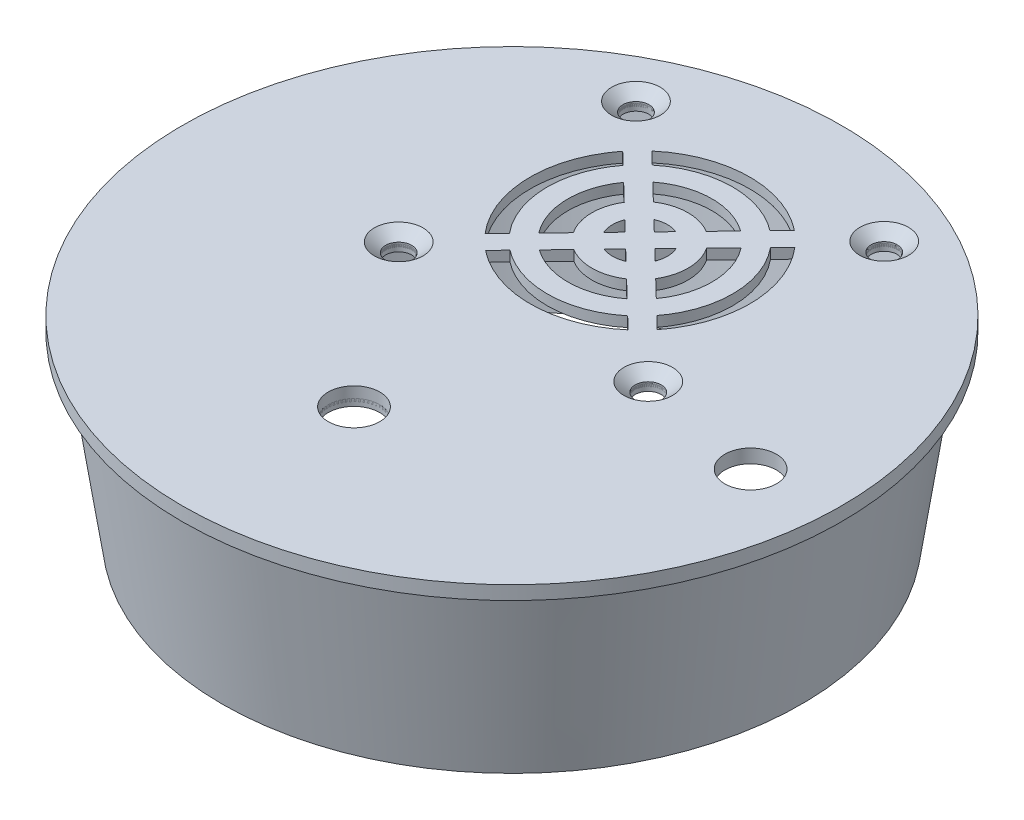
ISO-10303-21;
HEADER;
FILE_DESCRIPTION(('STEP AP214'),'2;1');
FILE_NAME('part.step','',(''),(''),'','','');
FILE_SCHEMA(('AUTOMOTIVE_DESIGN { 1 0 10303 214 1 1 1 1 }'));
ENDSEC;
DATA;
#1=APPLICATION_CONTEXT('core data for automotive mechanical design processes');
#2=APPLICATION_PROTOCOL_DEFINITION('international standard','automotive_design',2000,#1);
#3=PRODUCT_CONTEXT('',#1,'mechanical');
#4=PRODUCT('Part','Part','',(#3));
#5=PRODUCT_RELATED_PRODUCT_CATEGORY('part','',(#4));
#6=PRODUCT_DEFINITION_FORMATION('','',#4);
#7=PRODUCT_DEFINITION_CONTEXT('part definition',#1,'design');
#8=PRODUCT_DEFINITION('design','',#6,#7);
#9=PRODUCT_DEFINITION_SHAPE('','',#8);
#10=(LENGTH_UNIT() NAMED_UNIT(*) SI_UNIT(.MILLI.,.METRE.));
#11=(NAMED_UNIT(*) PLANE_ANGLE_UNIT() SI_UNIT($,.RADIAN.));
#12=(NAMED_UNIT(*) SI_UNIT($,.STERADIAN.) SOLID_ANGLE_UNIT());
#13=UNCERTAINTY_MEASURE_WITH_UNIT(LENGTH_MEASURE(1.E-05),#10,'distance_accuracy_value','');
#14=(GEOMETRIC_REPRESENTATION_CONTEXT(3) GLOBAL_UNCERTAINTY_ASSIGNED_CONTEXT((#13)) GLOBAL_UNIT_ASSIGNED_CONTEXT((#10,
#11,#12)) REPRESENTATION_CONTEXT('',''));
#15=CARTESIAN_POINT('',(0.,0.,0.));
#16=DIRECTION('',(0.,0.,1.));
#17=DIRECTION('',(1.,0.,0.));
#18=AXIS2_PLACEMENT_3D('',#15,#16,#17);
#19=CARTESIAN_POINT('',(-0.0601763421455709,-2.60000000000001,-18.6318585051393));
#20=DIRECTION('',(0.,-1.,0.));
#21=DIRECTION('',(0.,0.,-1.));
#22=AXIS2_PLACEMENT_3D('',#19,#20,#21);
#23=PLANE('',#22);
#24=CARTESIAN_POINT('',(17.7370644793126,-2.60000000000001,-36.4813260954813));
#25=DIRECTION('',(0.,-1.,0.));
#26=DIRECTION('',(0.,0.,-1.));
#27=AXIS2_PLACEMENT_3D('',#24,#25,#26);
#28=CIRCLE('',#27,1.89864999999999);
#29=CARTESIAN_POINT('',(19.4539908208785,-2.60000000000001,-37.2919035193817));
#30=VERTEX_POINT('',#29);
#31=CARTESIAN_POINT('',(18.5426074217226,-2.60000000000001,-38.2006202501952));
#32=VERTEX_POINT('',#31);
#33=EDGE_CURVE('E153',#30,#32,#28,.T.);
#34=ORIENTED_EDGE('',*,*,#33,.F.);
#35=CARTESIAN_POINT('',(-0.0601763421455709,-2.60000000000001,-18.6318585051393));
#36=DIRECTION('',(0.,-1.,0.));
#37=DIRECTION('',(0.,0.,-1.));
#38=AXIS2_PLACEMENT_3D('',#35,#36,#37);
#39=CIRCLE('',#38,27.);
#40=EDGE_CURVE('E162',#30,#32,#39,.T.);
#41=ORIENTED_EDGE('',*,*,#40,.T.);
#42=EDGE_LOOP('',(#34,#41));
#43=FACE_BOUND('',#42,.T.);
#44=CARTESIAN_POINT('',(-18.0132568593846,-2.60000000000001,-36.0773144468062));
#45=DIRECTION('',(0.,-1.,0.));
#46=DIRECTION('',(0.,0.,-1.));
#47=AXIS2_PLACEMENT_3D('',#44,#45,#46);
#48=CIRCLE('',#47,1.89864999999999);
#49=CARTESIAN_POINT('',(-18.0132568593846,-2.60000000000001,-37.9759644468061));
#50=VERTEX_POINT('',#49);
#51=EDGE_CURVE('E181',#50,#50,#48,.T.);
#52=ORIENTED_EDGE('',*,*,#51,.F.);
#53=EDGE_LOOP('',(#52));
#54=FACE_BOUND('',#53,.T.);
#55=CARTESIAN_POINT('',(-17.5514872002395,-2.60000000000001,-1.05945103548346));
#56=DIRECTION('',(0.,-1.,0.));
#57=DIRECTION('',(0.,0.,-1.));
#58=AXIS2_PLACEMENT_3D('',#55,#56,#57);
#59=CIRCLE('',#58,1.89864999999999);
#60=CARTESIAN_POINT('',(-15.8558846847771,-2.60000000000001,-1.91373666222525));
#61=VERTEX_POINT('',#60);
#62=CARTESIAN_POINT('',(-16.7050539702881,-2.60000000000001,-2.75898703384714));
#63=VERTEX_POINT('',#62);
#64=EDGE_CURVE('E136',#61,#63,#59,.T.);
#65=ORIENTED_EDGE('',*,*,#64,.F.);
#66=CARTESIAN_POINT('',(-0.0601763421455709,-2.60000000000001,-18.6318585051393));
#67=DIRECTION('',(0.,-1.,0.));
#68=DIRECTION('',(0.,0.,-1.));
#69=AXIS2_PLACEMENT_3D('',#66,#67,#68);
#70=CIRCLE('',#69,23.);
#71=EDGE_CURVE('E169',#63,#61,#70,.T.);
#72=ORIENTED_EDGE('',*,*,#71,.F.);
#73=EDGE_LOOP('',(#65,#72));
#74=FACE_BOUND('',#73,.T.);
#75=CARTESIAN_POINT('',(18.2238083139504,-2.60000000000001,-1.62651806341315));
#76=DIRECTION('',(0.,-1.,0.));
#77=DIRECTION('',(0.,0.,-1.));
#78=AXIS2_PLACEMENT_3D('',#75,#76,#77);
#79=CIRCLE('',#78,1.89864999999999);
#80=CARTESIAN_POINT('',(18.2238083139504,-2.60000000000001,-3.52516806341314));
#81=VERTEX_POINT('',#80);
#82=EDGE_CURVE('E177',#81,#81,#79,.T.);
#83=ORIENTED_EDGE('',*,*,#82,.F.);
#84=EDGE_LOOP('',(#83));
#85=FACE_BOUND('',#84,.T.);
#86=ADVANCED_FACE('F113',(#43,#54,#74,#85),#23,.T.);
#87=CARTESIAN_POINT('',(-0.0601763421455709,-1.60000000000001,-18.6318585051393));
#88=DIRECTION('',(0.,-1.,0.));
#89=DIRECTION('',(0.,0.,-1.));
#90=AXIS2_PLACEMENT_3D('',#87,#88,#89);
#91=PLANE('',#90);
#92=CARTESIAN_POINT('',(-18.0132568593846,-1.60000000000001,-36.0773144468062));
#93=DIRECTION('',(0.,-1.,0.));
#94=DIRECTION('',(0.,0.,-1.));
#95=AXIS2_PLACEMENT_3D('',#92,#93,#94);
#96=CIRCLE('',#95,1.89864999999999);
#97=CARTESIAN_POINT('',(-18.0132568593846,-1.60000000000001,-37.9759644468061));
#98=VERTEX_POINT('',#97);
#99=EDGE_CURVE('E163',#98,#98,#96,.T.);
#100=ORIENTED_EDGE('',*,*,#99,.T.);
#101=EDGE_LOOP('',(#100));
#102=FACE_BOUND('',#101,.T.);
#103=CARTESIAN_POINT('',(18.2238083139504,-1.60000000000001,-1.62651806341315));
#104=DIRECTION('',(0.,-1.,0.));
#105=DIRECTION('',(0.,0.,-1.));
#106=AXIS2_PLACEMENT_3D('',#103,#104,#105);
#107=CIRCLE('',#106,1.89864999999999);
#108=CARTESIAN_POINT('',(18.2238083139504,-1.60000000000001,-3.52516806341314));
#109=VERTEX_POINT('',#108);
#110=EDGE_CURVE('E175',#109,#109,#107,.T.);
#111=ORIENTED_EDGE('',*,*,#110,.T.);
#112=EDGE_LOOP('',(#111));
#113=FACE_BOUND('',#112,.T.);
#114=CARTESIAN_POINT('',(-0.0601763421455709,-1.60000000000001,-18.6318585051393));
#115=DIRECTION('',(0.,-1.,0.));
#116=DIRECTION('',(0.,0.,-1.));
#117=AXIS2_PLACEMENT_3D('',#114,#115,#116);
#118=CIRCLE('',#117,27.);
#119=CARTESIAN_POINT('',(19.4539908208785,-1.60000000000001,-37.2919035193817));
#120=VERTEX_POINT('',#119);
#121=CARTESIAN_POINT('',(18.5426074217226,-1.60000000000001,-38.2006202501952));
#122=VERTEX_POINT('',#121);
#123=EDGE_CURVE('E166',#120,#122,#118,.T.);
#124=ORIENTED_EDGE('',*,*,#123,.F.);
#125=CARTESIAN_POINT('',(17.7370644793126,-1.60000000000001,-36.4813260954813));
#126=DIRECTION('',(0.,-1.,0.));
#127=DIRECTION('',(0.,0.,-1.));
#128=AXIS2_PLACEMENT_3D('',#125,#126,#127);
#129=CIRCLE('',#128,1.89864999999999);
#130=EDGE_CURVE('E128',#120,#122,#129,.T.);
#131=ORIENTED_EDGE('',*,*,#130,.T.);
#132=EDGE_LOOP('',(#124,#131));
#133=FACE_BOUND('',#132,.T.);
#134=CARTESIAN_POINT('',(-0.0601763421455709,-1.60000000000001,-18.6318585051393));
#135=DIRECTION('',(0.,-1.,0.));
#136=DIRECTION('',(0.,0.,-1.));
#137=AXIS2_PLACEMENT_3D('',#134,#135,#136);
#138=CIRCLE('',#137,23.);
#139=CARTESIAN_POINT('',(-16.7050539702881,-1.60000000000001,-2.75898703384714));
#140=VERTEX_POINT('',#139);
#141=CARTESIAN_POINT('',(-15.8558846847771,-1.60000000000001,-1.91373666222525));
#142=VERTEX_POINT('',#141);
#143=EDGE_CURVE('E172',#140,#142,#138,.T.);
#144=ORIENTED_EDGE('',*,*,#143,.T.);
#145=CARTESIAN_POINT('',(-17.5514872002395,-1.60000000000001,-1.05945103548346));
#146=DIRECTION('',(0.,-1.,0.));
#147=DIRECTION('',(0.,0.,-1.));
#148=AXIS2_PLACEMENT_3D('',#145,#146,#147);
#149=CIRCLE('',#148,1.89864999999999);
#150=EDGE_CURVE('E185',#142,#140,#149,.T.);
#151=ORIENTED_EDGE('',*,*,#150,.T.);
#152=EDGE_LOOP('',(#144,#151));
#153=FACE_BOUND('',#152,.T.);
#154=ADVANCED_FACE('F202',(#102,#113,#133,#153),#91,.F.);
#155=CARTESIAN_POINT('',(-0.0601763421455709,-2.60000000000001,-18.6318585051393));
#156=DIRECTION('',(0.,1.,0.));
#157=DIRECTION('',(0.,0.,1.));
#158=AXIS2_PLACEMENT_3D('',#155,#156,#157);
#159=CYLINDRICAL_SURFACE('',#158,27.);
#160=ORIENTED_EDGE('',*,*,#123,.T.);
#161=DIRECTION('',(0.,1.,0.));
#162=VECTOR('',#161,1.);
#163=CARTESIAN_POINT('',(18.5426074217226,-3.69001260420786,-38.2006202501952));
#164=LINE('',#163,#162);
#165=EDGE_CURVE('E14',#122,#32,#164,.F.);
#166=ORIENTED_EDGE('',*,*,#165,.T.);
#167=ORIENTED_EDGE('',*,*,#40,.F.);
#168=DIRECTION('',(0.,1.,0.));
#169=VECTOR('',#168,1.);
#170=CARTESIAN_POINT('',(19.4539908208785,-3.69001260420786,-37.2919035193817));
#171=LINE('',#170,#169);
#172=EDGE_CURVE('E121',#30,#120,#171,.T.);
#173=ORIENTED_EDGE('',*,*,#172,.T.);
#174=EDGE_LOOP('',(#160,#166,#167,#173));
#175=FACE_BOUND('',#174,.T.);
#176=ADVANCED_FACE('F115',(#175),#159,.T.);
#177=CARTESIAN_POINT('',(-0.0601763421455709,-2.60000000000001,-18.6318585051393));
#178=DIRECTION('',(0.,1.,0.));
#179=DIRECTION('',(0.,0.,1.));
#180=AXIS2_PLACEMENT_3D('',#177,#178,#179);
#181=CYLINDRICAL_SURFACE('',#180,23.);
#182=DIRECTION('',(0.,1.,0.));
#183=VECTOR('',#182,1.);
#184=CARTESIAN_POINT('',(-15.8558846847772,-3.69001260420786,-1.91373666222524));
#185=LINE('',#184,#183);
#186=EDGE_CURVE('E158',#142,#61,#185,.F.);
#187=ORIENTED_EDGE('',*,*,#186,.F.);
#188=ORIENTED_EDGE('',*,*,#143,.F.);
#189=DIRECTION('',(0.,1.,0.));
#190=VECTOR('',#189,1.);
#191=CARTESIAN_POINT('',(-16.7050539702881,-3.69001260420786,-2.75898703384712));
#192=LINE('',#191,#190);
#193=EDGE_CURVE('E165',#63,#140,#192,.T.);
#194=ORIENTED_EDGE('',*,*,#193,.F.);
#195=ORIENTED_EDGE('',*,*,#71,.T.);
#196=EDGE_LOOP('',(#187,#188,#194,#195));
#197=FACE_BOUND('',#196,.T.);
#198=ADVANCED_FACE('F203',(#197),#181,.F.);
#199=CARTESIAN_POINT('',(18.2238083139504,0.,-1.62651806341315));
#200=DIRECTION('',(0.,1.,0.));
#201=DIRECTION('',(0.,0.,1.));
#202=AXIS2_PLACEMENT_3D('',#199,#200,#201);
#203=CYLINDRICAL_SURFACE('',#202,1.89864999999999);
#204=ORIENTED_EDGE('',*,*,#82,.T.);
#205=EDGE_LOOP('',(#204));
#206=FACE_BOUND('',#205,.T.);
#207=ORIENTED_EDGE('',*,*,#110,.F.);
#208=EDGE_LOOP('',(#207));
#209=FACE_BOUND('',#208,.T.);
#210=ADVANCED_FACE('F211',(#206,#209),#203,.F.);
#211=CARTESIAN_POINT('',(-17.5514872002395,0.,-1.05945103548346));
#212=DIRECTION('',(0.,1.,0.));
#213=DIRECTION('',(0.,0.,1.));
#214=AXIS2_PLACEMENT_3D('',#211,#212,#213);
#215=CYLINDRICAL_SURFACE('',#214,1.89864999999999);
#216=ORIENTED_EDGE('',*,*,#186,.T.);
#217=ORIENTED_EDGE('',*,*,#64,.T.);
#218=ORIENTED_EDGE('',*,*,#193,.T.);
#219=ORIENTED_EDGE('',*,*,#150,.F.);
#220=EDGE_LOOP('',(#216,#217,#218,#219));
#221=FACE_BOUND('',#220,.T.);
#222=ADVANCED_FACE('F204',(#221),#215,.F.);
#223=CARTESIAN_POINT('',(-18.0132568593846,0.,-36.0773144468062));
#224=DIRECTION('',(0.,1.,0.));
#225=DIRECTION('',(0.,0.,1.));
#226=AXIS2_PLACEMENT_3D('',#223,#224,#225);
#227=CYLINDRICAL_SURFACE('',#226,1.89864999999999);
#228=ORIENTED_EDGE('',*,*,#51,.T.);
#229=EDGE_LOOP('',(#228));
#230=FACE_BOUND('',#229,.T.);
#231=ORIENTED_EDGE('',*,*,#99,.F.);
#232=EDGE_LOOP('',(#231));
#233=FACE_BOUND('',#232,.T.);
#234=ADVANCED_FACE('F227',(#230,#233),#227,.F.);
#235=CARTESIAN_POINT('',(17.7370644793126,0.,-36.4813260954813));
#236=DIRECTION('',(0.,1.,0.));
#237=DIRECTION('',(0.,0.,1.));
#238=AXIS2_PLACEMENT_3D('',#235,#236,#237);
#239=CYLINDRICAL_SURFACE('',#238,1.89864999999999);
#240=ORIENTED_EDGE('',*,*,#130,.F.);
#241=ORIENTED_EDGE('',*,*,#172,.F.);
#242=ORIENTED_EDGE('',*,*,#33,.T.);
#243=ORIENTED_EDGE('',*,*,#165,.F.);
#244=EDGE_LOOP('',(#240,#241,#242,#243));
#245=FACE_BOUND('',#244,.T.);
#246=ADVANCED_FACE('F152',(#245),#239,.F.);
#247=CLOSED_SHELL('',(#86,#154,#176,#198,#210,#222,#234,#246));
#248=MANIFOLD_SOLID_BREP('B2',#247);
#249=CARTESIAN_POINT('',(0.,-2.60000000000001,23.));
#250=DIRECTION('',(0.,1.,0.));
#251=DIRECTION('',(0.,0.,1.));
#252=AXIS2_PLACEMENT_3D('',#249,#250,#251);
#253=CYLINDRICAL_SURFACE('',#252,8.);
#254=CARTESIAN_POINT('',(0.,-2.60000000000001,23.));
#255=DIRECTION('',(0.,-1.,0.));
#256=DIRECTION('',(0.,0.,-1.));
#257=AXIS2_PLACEMENT_3D('',#254,#255,#256);
#258=CIRCLE('',#257,8.);
#259=CARTESIAN_POINT('',(0.,-2.60000000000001,15.));
#260=VERTEX_POINT('',#259);
#261=EDGE_CURVE('E112',#260,#260,#258,.T.);
#262=ORIENTED_EDGE('',*,*,#261,.F.);
#263=EDGE_LOOP('',(#262));
#264=FACE_BOUND('',#263,.T.);
#265=CARTESIAN_POINT('',(0.,-1.60000000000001,23.));
#266=DIRECTION('',(0.,-1.,0.));
#267=DIRECTION('',(0.,0.,-1.));
#268=AXIS2_PLACEMENT_3D('',#265,#266,#267);
#269=CIRCLE('',#268,8.);
#270=CARTESIAN_POINT('',(0.,-1.60000000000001,15.));
#271=VERTEX_POINT('',#270);
#272=EDGE_CURVE('E297',#271,#271,#269,.T.);
#273=ORIENTED_EDGE('',*,*,#272,.T.);
#274=EDGE_LOOP('',(#273));
#275=FACE_BOUND('',#274,.T.);
#276=ADVANCED_FACE('F290',(#264,#275),#253,.T.);
#277=CARTESIAN_POINT('',(0.,-2.60000000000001,23.));
#278=DIRECTION('',(0.,-1.,0.));
#279=DIRECTION('',(0.,0.,-1.));
#280=AXIS2_PLACEMENT_3D('',#277,#278,#279);
#281=PLANE('',#280);
#282=CARTESIAN_POINT('',(0.,-2.60000000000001,23.));
#283=DIRECTION('',(0.,-1.,0.));
#284=DIRECTION('',(0.,0.,-1.));
#285=AXIS2_PLACEMENT_3D('',#282,#283,#284);
#286=CIRCLE('',#285,3.75);
#287=CARTESIAN_POINT('',(0.,-2.60000000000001,19.25));
#288=VERTEX_POINT('',#287);
#289=EDGE_CURVE('E302',#288,#288,#286,.T.);
#290=ORIENTED_EDGE('',*,*,#289,.F.);
#291=EDGE_LOOP('',(#290));
#292=FACE_BOUND('',#291,.T.);
#293=ORIENTED_EDGE('',*,*,#261,.T.);
#294=EDGE_LOOP('',(#293));
#295=FACE_BOUND('',#294,.T.);
#296=ADVANCED_FACE('F319',(#292,#295),#281,.T.);
#297=CARTESIAN_POINT('',(0.,-1.60000000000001,23.));
#298=DIRECTION('',(0.,-1.,0.));
#299=DIRECTION('',(0.,0.,-1.));
#300=AXIS2_PLACEMENT_3D('',#297,#298,#299);
#301=PLANE('',#300);
#302=CARTESIAN_POINT('',(0.,-1.60000000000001,23.));
#303=DIRECTION('',(0.,-1.,0.));
#304=DIRECTION('',(0.,0.,-1.));
#305=AXIS2_PLACEMENT_3D('',#302,#303,#304);
#306=CIRCLE('',#305,3.75);
#307=CARTESIAN_POINT('',(0.,-1.60000000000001,19.25));
#308=VERTEX_POINT('',#307);
#309=EDGE_CURVE('E293',#308,#308,#306,.T.);
#310=ORIENTED_EDGE('',*,*,#309,.T.);
#311=EDGE_LOOP('',(#310));
#312=FACE_BOUND('',#311,.T.);
#313=ORIENTED_EDGE('',*,*,#272,.F.);
#314=EDGE_LOOP('',(#313));
#315=FACE_BOUND('',#314,.T.);
#316=ADVANCED_FACE('F310',(#312,#315),#301,.F.);
#317=CARTESIAN_POINT('',(0.,-5.,23.));
#318=DIRECTION('',(0.,1.,0.));
#319=DIRECTION('',(0.,0.,1.));
#320=AXIS2_PLACEMENT_3D('',#317,#318,#319);
#321=CYLINDRICAL_SURFACE('',#320,3.75);
#322=ORIENTED_EDGE('',*,*,#289,.T.);
#323=EDGE_LOOP('',(#322));
#324=FACE_BOUND('',#323,.T.);
#325=ORIENTED_EDGE('',*,*,#309,.F.);
#326=EDGE_LOOP('',(#325));
#327=FACE_BOUND('',#326,.T.);
#328=ADVANCED_FACE('F313',(#324,#327),#321,.F.);
#329=CLOSED_SHELL('',(#276,#296,#316,#328));
#330=MANIFOLD_SOLID_BREP('B8',#329);
#331=CARTESIAN_POINT('',(-16.1609925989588,988.4,-18.8096781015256));
#332=CARTESIAN_POINT('',(-16.1609925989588,988.4,-19.8568669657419));
#333=CARTESIAN_POINT('',(-15.9547143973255,988.4,-21.9512446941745));
#334=CARTESIAN_POINT('',(-15.0383532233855,988.4,-24.9720826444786));
#335=CARTESIAN_POINT('',(-13.5502634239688,988.4,-27.7561028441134));
#336=CARTESIAN_POINT('',(-11.5476314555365,988.4,-30.1963169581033));
#337=CARTESIAN_POINT('',(-9.10741734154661,988.4,-32.1989489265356));
#338=CARTESIAN_POINT('',(-6.32339714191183,988.4,-33.6870387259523));
#339=CARTESIAN_POINT('',(-3.30255919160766,988.4,-34.6033998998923));
#340=CARTESIAN_POINT('',(-0.160992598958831,988.4,-34.9128172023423));
#341=CARTESIAN_POINT('',(2.98057399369,988.4,-34.6033998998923));
#342=CARTESIAN_POINT('',(6.00141194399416,988.4,-33.6870387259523));
#343=CARTESIAN_POINT('',(8.78543214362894,988.4,-32.1989489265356));
#344=CARTESIAN_POINT('',(11.2256462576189,988.4,-30.1963169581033));
#345=CARTESIAN_POINT('',(13.2282782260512,988.4,-27.7561028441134));
#346=CARTESIAN_POINT('',(14.7163680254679,988.4,-24.9720826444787));
#347=CARTESIAN_POINT('',(15.6327291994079,988.4,-21.9512446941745));
#348=CARTESIAN_POINT('',(15.9421465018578,988.4,-18.8096781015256));
#349=CARTESIAN_POINT('',(15.6327291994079,988.4,-15.6681115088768));
#350=CARTESIAN_POINT('',(14.7163680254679,988.4,-12.6472735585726));
#351=CARTESIAN_POINT('',(13.2282782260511,988.4,-9.86325335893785));
#352=CARTESIAN_POINT('',(11.2256462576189,988.4,-7.42303924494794));
#353=CARTESIAN_POINT('',(8.78543214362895,988.4,-5.42040727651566));
#354=CARTESIAN_POINT('',(6.00141194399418,988.4,-3.93231747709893));
#355=CARTESIAN_POINT('',(2.98057399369,988.4,-3.01595630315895));
#356=CARTESIAN_POINT('',(-0.160992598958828,988.4,-2.70653900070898));
#357=CARTESIAN_POINT('',(-3.30255919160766,988.4,-3.01595630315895));
#358=CARTESIAN_POINT('',(-6.32339714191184,988.4,-3.93231747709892));
#359=CARTESIAN_POINT('',(-9.1074173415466,988.4,-5.42040727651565));
#360=CARTESIAN_POINT('',(-11.5476314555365,988.4,-7.42303924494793));
#361=CARTESIAN_POINT('',(-13.5502634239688,988.4,-9.86325335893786));
#362=CARTESIAN_POINT('',(-15.0383532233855,988.4,-12.6472735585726));
#363=CARTESIAN_POINT('',(-15.9547143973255,988.4,-15.6681115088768));
#364=CARTESIAN_POINT('',(-16.1609925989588,988.4,-17.7624892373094));
#365=CARTESIAN_POINT('',(-16.1609925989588,988.4,-18.8096781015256));
#366=B_SPLINE_CURVE_WITH_KNOTS('',3,(#331,#332,#333,#334,#335,#336,#337,#338,#339,#340,#341,
#342,#343,#344,#345,#346,#347,#348,#349,#350,#351,#352,#353,#354,#355,#356,#357,#358,#359,#360,
#361,#362,#363,#364,#365),.UNSPECIFIED.,.T.,.F.,(4,1,1,1,1,1,1,1,1,1,1,1,1,1,1,1,1,1,1,1,1,1,1,
1,1,1,1,1,1,1,1,1,4),(0.,0.03125,0.0625,0.09375,0.125,0.15625,0.1875,0.21875,0.25,0.28125,
0.3125,0.34375,0.375,0.40625,0.4375,0.46875,0.5,0.53125,0.5625,0.59375,0.625,0.65625,0.6875,
0.71875,0.75,0.78125,0.8125,0.84375,0.875,0.90625,0.9375,0.96875,1.),.UNSPECIFIED.);
#367=DIRECTION('',(0.,-1.,0.));
#368=VECTOR('',#367,1.);
#369=SURFACE_OF_LINEAR_EXTRUSION('',#366,#368);
#370=CARTESIAN_POINT('',(-16.1609925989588,-1.50000000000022,-18.8096781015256));
#371=CARTESIAN_POINT('',(-16.1609925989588,-1.5000000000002,-19.8568669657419));
#372=CARTESIAN_POINT('',(-15.9547143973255,-1.50000000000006,-21.9512446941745));
#373=CARTESIAN_POINT('',(-15.0383532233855,-1.50000000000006,-24.9720826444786));
#374=CARTESIAN_POINT('',(-13.5502634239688,-1.50000000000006,-27.7561028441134));
#375=CARTESIAN_POINT('',(-11.5476314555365,-1.49999999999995,-30.1963169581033));
#376=CARTESIAN_POINT('',(-9.10741734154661,-1.49999999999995,-32.1989489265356));
#377=CARTESIAN_POINT('',(-6.32339714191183,-1.50000000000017,-33.6870387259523));
#378=CARTESIAN_POINT('',(-3.30255919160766,-1.50000000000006,-34.6033998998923));
#379=CARTESIAN_POINT('',(-0.160992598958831,-1.50000000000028,-34.9128172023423));
#380=CARTESIAN_POINT('',(2.98057399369,-1.49999999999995,-34.6033998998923));
#381=CARTESIAN_POINT('',(6.00141194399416,-1.50000000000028,-33.6870387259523));
#382=CARTESIAN_POINT('',(8.78543214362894,-1.50000000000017,-32.1989489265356));
#383=CARTESIAN_POINT('',(11.2256462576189,-1.50000000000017,-30.1963169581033));
#384=CARTESIAN_POINT('',(13.2282782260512,-1.50000000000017,-27.7561028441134));
#385=CARTESIAN_POINT('',(14.7163680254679,-1.49999999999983,-24.9720826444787));
#386=CARTESIAN_POINT('',(15.6327291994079,-1.50000000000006,-21.9512446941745));
#387=CARTESIAN_POINT('',(15.9421465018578,-1.50000000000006,-18.8096781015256));
#388=CARTESIAN_POINT('',(15.6327291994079,-1.49999999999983,-15.6681115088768));
#389=CARTESIAN_POINT('',(14.7163680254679,-1.50000000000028,-12.6472735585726));
#390=CARTESIAN_POINT('',(13.2282782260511,-1.50000000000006,-9.86325335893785));
#391=CARTESIAN_POINT('',(11.2256462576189,-1.49999999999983,-7.42303924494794));
#392=CARTESIAN_POINT('',(8.78543214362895,-1.50000000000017,-5.42040727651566));
#393=CARTESIAN_POINT('',(6.00141194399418,-1.50000000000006,-3.93231747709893));
#394=CARTESIAN_POINT('',(2.98057399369,-1.49999999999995,-3.01595630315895));
#395=CARTESIAN_POINT('',(-0.160992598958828,-1.49999999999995,-2.70653900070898));
#396=CARTESIAN_POINT('',(-3.30255919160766,-1.49999999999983,-3.01595630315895));
#397=CARTESIAN_POINT('',(-6.32339714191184,-1.50000000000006,-3.93231747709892));
#398=CARTESIAN_POINT('',(-9.1074173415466,-1.49999999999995,-5.42040727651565));
#399=CARTESIAN_POINT('',(-11.5476314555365,-1.49999999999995,-7.42303924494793));
#400=CARTESIAN_POINT('',(-13.5502634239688,-1.50000000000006,-9.86325335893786));
#401=CARTESIAN_POINT('',(-15.0383532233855,-1.49999999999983,-12.6472735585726));
#402=CARTESIAN_POINT('',(-15.9547143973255,-1.50000000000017,-15.6681115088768));
#403=CARTESIAN_POINT('',(-16.1609925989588,-1.50000000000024,-17.7624892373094));
#404=CARTESIAN_POINT('',(-16.1609925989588,-1.50000000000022,-18.8096781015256));
#405=B_SPLINE_CURVE_WITH_KNOTS('',3,(#370,#371,#372,#373,#374,#375,#376,#377,#378,#379,#380,
#381,#382,#383,#384,#385,#386,#387,#388,#389,#390,#391,#392,#393,#394,#395,#396,#397,#398,#399,
#400,#401,#402,#403,#404),.UNSPECIFIED.,.T.,.F.,(4,1,1,1,1,1,1,1,1,1,1,1,1,1,1,1,1,1,1,1,1,1,1,
1,1,1,1,1,1,1,1,1,4),(0.,0.03125,0.0625,0.09375,0.125,0.15625,0.1875,0.21875,0.25,0.28125,
0.3125,0.34375,0.375,0.40625,0.4375,0.46875,0.5,0.53125,0.5625,0.59375,0.625,0.65625,0.6875,
0.71875,0.75,0.78125,0.8125,0.84375,0.875,0.90625,0.9375,0.96875,1.),.UNSPECIFIED.);
#406=CARTESIAN_POINT('',(-10.1476094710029,-1.5,-6.30890739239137));
#407=VERTEX_POINT('',#406);
#408=CARTESIAN_POINT('',(10.2558093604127,-1.50000000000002,-6.66505186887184));
#409=VERTEX_POINT('',#408);
#410=EDGE_CURVE('E664',#407,#409,#405,.F.);
#411=ORIENTED_EDGE('',*,*,#410,.F.);
#412=CARTESIAN_POINT('',(-10.1475237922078,-1.49999999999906,-6.30898751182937));
#413=DIRECTION('',(0.,1.,0.));
#414=VECTOR('',#413,1.);
#415=LINE('',#412,#414);
#416=CARTESIAN_POINT('',(-10.1476094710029,0.,-6.30890739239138));
#417=VERTEX_POINT('',#416);
#418=EDGE_CURVE('E1069',#417,#407,#415,.F.);
#419=ORIENTED_EDGE('',*,*,#418,.F.);
#420=CARTESIAN_POINT('',(-16.1609925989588,-1.66533453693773E-13,-18.8096781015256));
#421=CARTESIAN_POINT('',(-16.1609925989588,-1.48029736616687E-13,-19.8568669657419));
#422=CARTESIAN_POINT('',(-15.9547143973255,0.,-21.9512446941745));
#423=CARTESIAN_POINT('',(-15.0383532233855,0.,-24.9720826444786));
#424=CARTESIAN_POINT('',(-13.5502634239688,0.,-27.7561028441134));
#425=CARTESIAN_POINT('',(-11.5476314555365,1.11022302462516E-13,-30.1963169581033));
#426=CARTESIAN_POINT('',(-9.10741734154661,1.11022302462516E-13,-32.1989489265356));
#427=CARTESIAN_POINT('',(-6.32339714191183,-1.11022302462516E-13,-33.6870387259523));
#428=CARTESIAN_POINT('',(-3.30255919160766,0.,-34.6033998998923));
#429=CARTESIAN_POINT('',(-0.160992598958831,-2.22044604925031E-13,-34.9128172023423));
#430=CARTESIAN_POINT('',(2.98057399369,1.11022302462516E-13,-34.6033998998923));
#431=CARTESIAN_POINT('',(6.00141194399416,-2.22044604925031E-13,-33.6870387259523));
#432=CARTESIAN_POINT('',(8.78543214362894,-1.11022302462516E-13,-32.1989489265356));
#433=CARTESIAN_POINT('',(11.2256462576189,-1.11022302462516E-13,-30.1963169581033));
#434=CARTESIAN_POINT('',(13.2282782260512,-1.11022302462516E-13,-27.7561028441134));
#435=CARTESIAN_POINT('',(14.7163680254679,2.22044604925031E-13,-24.9720826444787));
#436=CARTESIAN_POINT('',(15.6327291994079,0.,-21.9512446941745));
#437=CARTESIAN_POINT('',(15.9421465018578,0.,-18.8096781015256));
#438=CARTESIAN_POINT('',(15.6327291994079,2.22044604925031E-13,-15.6681115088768));
#439=CARTESIAN_POINT('',(14.7163680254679,-2.22044604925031E-13,-12.6472735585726));
#440=CARTESIAN_POINT('',(13.2282782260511,0.,-9.86325335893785));
#441=CARTESIAN_POINT('',(11.2256462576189,2.22044604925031E-13,-7.42303924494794));
#442=CARTESIAN_POINT('',(8.78543214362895,-1.11022302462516E-13,-5.42040727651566));
#443=CARTESIAN_POINT('',(6.00141194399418,0.,-3.93231747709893));
#444=CARTESIAN_POINT('',(2.98057399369,1.11022302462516E-13,-3.01595630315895));
#445=CARTESIAN_POINT('',(-0.160992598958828,1.11022302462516E-13,-2.70653900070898));
#446=CARTESIAN_POINT('',(-3.30255919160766,2.22044604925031E-13,-3.01595630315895));
#447=CARTESIAN_POINT('',(-6.32339714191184,0.,-3.93231747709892));
#448=CARTESIAN_POINT('',(-9.1074173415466,1.11022302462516E-13,-5.42040727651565));
#449=CARTESIAN_POINT('',(-11.5476314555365,1.11022302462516E-13,-7.42303924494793));
#450=CARTESIAN_POINT('',(-13.5502634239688,0.,-9.86325335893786));
#451=CARTESIAN_POINT('',(-15.0383532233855,2.22044604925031E-13,-12.6472735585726));
#452=CARTESIAN_POINT('',(-15.9547143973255,-1.11022302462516E-13,-15.6681115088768));
#453=CARTESIAN_POINT('',(-16.1609925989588,-1.8503717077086E-13,-17.7624892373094));
#454=CARTESIAN_POINT('',(-16.1609925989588,-1.66533453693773E-13,-18.8096781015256));
#455=B_SPLINE_CURVE_WITH_KNOTS('',3,(#420,#421,#422,#423,#424,#425,#426,#427,#428,#429,#430,
#431,#432,#433,#434,#435,#436,#437,#438,#439,#440,#441,#442,#443,#444,#445,#446,#447,#448,#449,
#450,#451,#452,#453,#454),.UNSPECIFIED.,.T.,.F.,(4,1,1,1,1,1,1,1,1,1,1,1,1,1,1,1,1,1,1,1,1,1,1,
1,1,1,1,1,1,1,1,1,4),(0.,0.03125,0.0625,0.09375,0.125,0.15625,0.1875,0.21875,0.25,0.28125,
0.3125,0.34375,0.375,0.40625,0.4375,0.46875,0.5,0.53125,0.5625,0.59375,0.625,0.65625,0.6875,
0.71875,0.75,0.78125,0.8125,0.84375,0.875,0.90625,0.9375,0.96875,1.),.UNSPECIFIED.);
#456=CARTESIAN_POINT('',(10.2558093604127,0.,-6.66505186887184));
#457=VERTEX_POINT('',#456);
#458=EDGE_CURVE('E1330',#457,#417,#455,.T.);
#459=ORIENTED_EDGE('',*,*,#458,.F.);
#460=CARTESIAN_POINT('',(10.2557255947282,1.38777878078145E-11,-6.66512488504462));
#461=DIRECTION('',(0.,-1.,0.));
#462=VECTOR('',#461,1.);
#463=LINE('',#460,#462);
#464=EDGE_CURVE('E1170',#457,#409,#463,.T.);
#465=ORIENTED_EDGE('',*,*,#464,.T.);
#466=EDGE_LOOP('',(#411,#419,#459,#465));
#467=FACE_BOUND('',#466,.T.);
#468=ADVANCED_FACE('F352',(#467),#369,.F.);
#469=CARTESIAN_POINT('',(11.9836336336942,0.,-29.2264800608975));
#470=VERTEX_POINT('',#469);
#471=CARTESIAN_POINT('',(12.3397781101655,0.,-8.82306122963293));
#472=VERTEX_POINT('',#471);
#473=EDGE_CURVE('E691',#470,#472,#455,.T.);
#474=ORIENTED_EDGE('',*,*,#473,.F.);
#475=CARTESIAN_POINT('',(11.9835606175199,1.22124532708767E-11,-29.2263962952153));
#476=DIRECTION('',(0.,-1.,0.));
#477=VECTOR('',#476,1.);
#478=LINE('',#475,#477);
#479=CARTESIAN_POINT('',(11.9836336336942,-1.50000000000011,-29.2264800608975));
#480=VERTEX_POINT('',#479);
#481=EDGE_CURVE('E378',#470,#480,#478,.T.);
#482=ORIENTED_EDGE('',*,*,#481,.T.);
#483=CARTESIAN_POINT('',(12.3397781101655,-1.50000000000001,-8.82306122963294));
#484=VERTEX_POINT('',#483);
#485=EDGE_CURVE('E666',#484,#480,#405,.F.);
#486=ORIENTED_EDGE('',*,*,#485,.F.);
#487=CARTESIAN_POINT('',(12.3396979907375,-1.49999999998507,-8.82314690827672));
#488=DIRECTION('',(0.,1.,0.));
#489=VECTOR('',#488,1.);
#490=LINE('',#487,#489);
#491=EDGE_CURVE('E916',#472,#484,#490,.F.);
#492=ORIENTED_EDGE('',*,*,#491,.F.);
#493=EDGE_LOOP('',(#474,#482,#486,#492));
#494=FACE_BOUND('',#493,.T.);
#495=ADVANCED_FACE('F1156',(#494),#369,.F.);
#496=CARTESIAN_POINT('',(10.3064566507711,998.4,-6.6161344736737));
#497=DIRECTION('',(-0.694658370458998,0.,0.719339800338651));
#498=DIRECTION('',(0.719339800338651,0.,0.694658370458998));
#499=AXIS2_PLACEMENT_3D('',#496,#497,#498);
#500=PLANE('',#499);
#501=DIRECTION('',(0.,1.,0.));
#502=VECTOR('',#501,1.);
#503=CARTESIAN_POINT('',(-0.123970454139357,998.4,-16.6886808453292));
#504=LINE('',#503,#502);
#505=CARTESIAN_POINT('',(-0.123970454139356,-1.50000000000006,-16.6886808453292));
#506=VERTEX_POINT('',#505);
#507=CARTESIAN_POINT('',(-0.123970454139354,0.,-16.6886808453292));
#508=VERTEX_POINT('',#507);
#509=EDGE_CURVE('E1090',#506,#508,#504,.T.);
#510=ORIENTED_EDGE('',*,*,#509,.F.);
#511=DIRECTION('',(0.719339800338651,0.,0.694658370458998));
#512=VECTOR('',#511,1.);
#513=CARTESIAN_POINT('',(10.3064566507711,-1.50000000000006,-6.6161344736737));
#514=LINE('',#513,#512);
#515=CARTESIAN_POINT('',(1.46442799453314,-1.5000000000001,-15.1547822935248));
#516=VERTEX_POINT('',#515);
#517=EDGE_CURVE('E812',#506,#516,#514,.T.);
#518=ORIENTED_EDGE('',*,*,#517,.T.);
#519=DIRECTION('',(0.,-1.,0.));
#520=VECTOR('',#519,1.);
#521=CARTESIAN_POINT('',(1.4644279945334,-0.749999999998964,-15.1547822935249));
#522=LINE('',#521,#520);
#523=CARTESIAN_POINT('',(1.4644279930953,0.,-15.1547822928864));
#524=VERTEX_POINT('',#523);
#525=EDGE_CURVE('E901',#524,#516,#522,.T.);
#526=ORIENTED_EDGE('',*,*,#525,.F.);
#527=DIRECTION('',(0.719339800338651,0.,0.694658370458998));
#528=VECTOR('',#527,1.);
#529=CARTESIAN_POINT('',(10.3064566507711,0.,-6.6161344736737));
#530=LINE('',#529,#528);
#531=EDGE_CURVE('E783',#508,#524,#530,.T.);
#532=ORIENTED_EDGE('',*,*,#531,.F.);
#533=EDGE_LOOP('',(#510,#518,#526,#532));
#534=FACE_BOUND('',#533,.T.);
#535=ADVANCED_FACE('F870',(#534),#500,.T.);
#536=CARTESIAN_POINT('',(12.3904317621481,998.4,-8.77415387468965));
#537=DIRECTION('',(0.694658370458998,0.,-0.719339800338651));
#538=DIRECTION('',(-0.719339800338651,0.,-0.694658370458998));
#539=AXIS2_PLACEMENT_3D('',#536,#537,#538);
#540=PLANE('',#539);
#541=DIRECTION('',(0.,-1.,0.));
#542=VECTOR('',#541,1.);
#543=CARTESIAN_POINT('',(1.96000465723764,998.4,-18.8467002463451));
#544=LINE('',#543,#542);
#545=CARTESIAN_POINT('',(1.96000465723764,0.,-18.8467002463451));
#546=VERTEX_POINT('',#545);
#547=CARTESIAN_POINT('',(1.96000465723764,-1.50000000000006,-18.8467002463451));
#548=VERTEX_POINT('',#547);
#549=EDGE_CURVE('E1088',#546,#548,#544,.T.);
#550=ORIENTED_EDGE('',*,*,#549,.F.);
#551=DIRECTION('',(-0.719339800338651,0.,-0.694658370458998));
#552=VECTOR('',#551,1.);
#553=CARTESIAN_POINT('',(12.3904317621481,0.,-8.77415387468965));
#554=LINE('',#553,#552);
#555=CARTESIAN_POINT('',(3.54838157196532,0.,-17.3128224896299));
#556=VERTEX_POINT('',#555);
#557=EDGE_CURVE('E807',#556,#546,#554,.T.);
#558=ORIENTED_EDGE('',*,*,#557,.F.);
#559=DIRECTION('',(0.,-1.,0.));
#560=VECTOR('',#559,1.);
#561=CARTESIAN_POINT('',(3.54838157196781,-0.749999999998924,-17.3128224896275));
#562=LINE('',#561,#560);
#563=CARTESIAN_POINT('',(3.54838157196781,-1.50000000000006,-17.3128224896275));
#564=VERTEX_POINT('',#563);
#565=EDGE_CURVE('E757',#564,#556,#562,.F.);
#566=ORIENTED_EDGE('',*,*,#565,.F.);
#567=DIRECTION('',(-0.719339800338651,0.,-0.694658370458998));
#568=VECTOR('',#567,1.);
#569=CARTESIAN_POINT('',(12.3904317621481,-1.50000000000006,-8.77415387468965));
#570=LINE('',#569,#568);
#571=EDGE_CURVE('E811',#564,#548,#570,.T.);
#572=ORIENTED_EDGE('',*,*,#571,.T.);
#573=EDGE_LOOP('',(#550,#558,#566,#572));
#574=FACE_BOUND('',#573,.T.);
#575=ADVANCED_FACE('F1376',(#574),#540,.T.);
#576=CARTESIAN_POINT('',(-4.16099259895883,998.4,-18.8096781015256));
#577=CARTESIAN_POINT('',(-4.16097806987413,998.4,-19.0715244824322));
#578=CARTESIAN_POINT('',(-4.11084702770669,998.4,-19.5953024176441));
#579=CARTESIAN_POINT('',(-3.8797192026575,998.4,-20.3498740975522));
#580=CARTESIAN_POINT('',(-3.50959727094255,998.4,-21.0470290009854));
#581=CARTESIAN_POINT('',(-3.00726870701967,998.4,-21.6556913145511));
#582=CARTESIAN_POINT('',(-2.39850510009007,998.4,-22.1581782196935));
#583=CARTESIAN_POINT('',(-1.70148611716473,998.4,-22.5282736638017));
#584=CARTESIAN_POINT('',(-0.946769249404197,998.4,-22.7595479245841));
#585=CARTESIAN_POINT('',(-0.161178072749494,998.4,-22.8347337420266));
#586=CARTESIAN_POINT('',(0.624594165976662,998.4,-22.7595857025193));
#587=CARTESIAN_POINT('',(1.37915815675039,998.4,-22.5284156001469));
#588=CARTESIAN_POINT('',(2.07635913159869,998.4,-22.158285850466));
#589=CARTESIAN_POINT('',(2.68502039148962,998.4,-21.6559533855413));
#590=CARTESIAN_POINT('',(3.1875075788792,998.4,-21.0471908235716));
#591=CARTESIAN_POINT('',(3.55760294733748,998.4,-20.3501715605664));
#592=CARTESIAN_POINT('',(3.78887722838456,998.4,-19.5954547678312));
#593=CARTESIAN_POINT('',(3.86406304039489,998.4,-18.8098635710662));
#594=CARTESIAN_POINT('',(3.78891500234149,998.4,-18.0240913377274));
#595=CARTESIAN_POINT('',(3.55774489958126,998.4,-17.2695273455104));
#596=CARTESIAN_POINT('',(3.18761514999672,998.4,-16.5723263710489));
#597=CARTESIAN_POINT('',(2.68528268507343,998.4,-15.9636651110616));
#598=CARTESIAN_POINT('',(2.07652012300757,998.4,-15.4611779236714));
#599=CARTESIAN_POINT('',(1.37950086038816,998.4,-15.0910825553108));
#600=CARTESIAN_POINT('',(0.624784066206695,998.4,-14.8598082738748));
#601=CARTESIAN_POINT('',(-0.160807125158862,998.4,-14.7846224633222));
#602=CARTESIAN_POINT('',(-0.946579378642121,998.4,-14.8597704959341));
#603=CARTESIAN_POINT('',(-1.70114329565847,998.4,-15.090940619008));
#604=CARTESIAN_POINT('',(-2.39834455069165,998.4,-15.4610702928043));
#605=CARTESIAN_POINT('',(-3.00700476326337,998.4,-15.9634030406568));
#606=CARTESIAN_POINT('',(-3.50949585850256,998.4,-16.5721645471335));
#607=CARTESIAN_POINT('',(-3.87959902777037,998.4,-17.2692299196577));
#608=CARTESIAN_POINT('',(-4.11091568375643,998.4,-18.0239390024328));
#609=CARTESIAN_POINT('',(-4.161007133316,998.4,-18.5477366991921));
#610=CARTESIAN_POINT('',(-4.16099259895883,998.4,-18.8096781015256));
#611=B_SPLINE_CURVE_WITH_KNOTS('',3,(#576,#577,#578,#579,#580,#581,#582,#583,#584,#585,#586,
#587,#588,#589,#590,#591,#592,#593,#594,#595,#596,#597,#598,#599,#600,#601,#602,#603,#604,#605,
#606,#607,#608,#609,#610),.UNSPECIFIED.,.T.,.F.,(4,1,1,1,1,1,1,1,1,1,1,1,1,1,1,1,1,1,1,1,1,1,1,
1,1,1,1,1,1,1,1,1,4),(0.,0.0312443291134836,0.0624997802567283,0.0937386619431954,
0.12499978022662,0.15623866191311,0.187499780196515,0.218738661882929,0.249999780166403,
0.281238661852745,0.312499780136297,0.34373866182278,0.374999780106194,0.406238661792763,
0.437499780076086,0.46873866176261,0.499999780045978,0.531238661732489,0.562499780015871,
0.593738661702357,0.624999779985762,0.656238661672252,0.687499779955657,0.718738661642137,
0.749999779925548,0.781238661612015,0.812499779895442,0.843738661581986,0.874999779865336,
0.906238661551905,0.937499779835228,0.968744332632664,1.),.UNSPECIFIED.);
#612=DIRECTION('',(0.,-1.,0.));
#613=VECTOR('',#612,1.);
#614=SURFACE_OF_LINEAR_EXTRUSION('',#611,#613);
#615=DIRECTION('',(0.,-1.,0.));
#616=VECTOR('',#615,1.);
#617=CARTESIAN_POINT('',(3.49390320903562,-0.749999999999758,-20.4350986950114));
#618=LINE('',#617,#616);
#619=CARTESIAN_POINT('',(3.49390320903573,-1.50000000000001,-20.4350986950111));
#620=VERTEX_POINT('',#619);
#621=CARTESIAN_POINT('',(3.49390321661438,0.,-20.4350986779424));
#622=VERTEX_POINT('',#621);
#623=EDGE_CURVE('E1085',#620,#622,#618,.F.);
#624=ORIENTED_EDGE('',*,*,#623,.F.);
#625=CARTESIAN_POINT('',(-4.16099259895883,-1.50000000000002,-18.8096781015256));
#626=CARTESIAN_POINT('',(-4.16097806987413,-1.49999999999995,-19.0715244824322));
#627=CARTESIAN_POINT('',(-4.11084702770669,-1.49999999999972,-19.5953024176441));
#628=CARTESIAN_POINT('',(-3.8797192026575,-1.50000000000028,-20.3498740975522));
#629=CARTESIAN_POINT('',(-3.50959727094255,-1.50000000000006,-21.0470290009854));
#630=CARTESIAN_POINT('',(-3.00726870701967,-1.49999999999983,-21.6556913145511));
#631=CARTESIAN_POINT('',(-2.39850510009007,-1.50000000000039,-22.1581782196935));
#632=CARTESIAN_POINT('',(-1.70148611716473,-1.49999999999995,-22.5282736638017));
#633=CARTESIAN_POINT('',(-0.946769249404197,-1.50000000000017,-22.7595479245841));
#634=CARTESIAN_POINT('',(-0.161178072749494,-1.50000000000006,-22.8347337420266));
#635=CARTESIAN_POINT('',(0.624594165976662,-1.50000000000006,-22.7595857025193));
#636=CARTESIAN_POINT('',(1.37915815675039,-1.49999999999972,-22.5284156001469));
#637=CARTESIAN_POINT('',(2.07635913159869,-1.50000000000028,-22.158285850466));
#638=CARTESIAN_POINT('',(2.68502039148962,-1.50000000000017,-21.6559533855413));
#639=CARTESIAN_POINT('',(3.1875075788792,-1.50000000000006,-21.0471908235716));
#640=CARTESIAN_POINT('',(3.55760294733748,-1.49999999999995,-20.3501715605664));
#641=CARTESIAN_POINT('',(3.78887722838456,-1.50000000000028,-19.5954547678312));
#642=CARTESIAN_POINT('',(3.86406304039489,-1.49999999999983,-18.8098635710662));
#643=CARTESIAN_POINT('',(3.78891500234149,-1.50000000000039,-18.0240913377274));
#644=CARTESIAN_POINT('',(3.55774489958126,-1.49999999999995,-17.2695273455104));
#645=CARTESIAN_POINT('',(3.18761514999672,-1.50000000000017,-16.5723263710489));
#646=CARTESIAN_POINT('',(2.68528268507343,-1.49999999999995,-15.9636651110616));
#647=CARTESIAN_POINT('',(2.07652012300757,-1.49999999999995,-15.4611779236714));
#648=CARTESIAN_POINT('',(1.37950086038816,-1.50000000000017,-15.0910825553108));
#649=CARTESIAN_POINT('',(0.624784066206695,-1.50000000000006,-14.8598082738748));
#650=CARTESIAN_POINT('',(-0.160807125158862,-1.50000000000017,-14.7846224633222));
#651=CARTESIAN_POINT('',(-0.946579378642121,-1.49999999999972,-14.8597704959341));
#652=CARTESIAN_POINT('',(-1.70114329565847,-1.50000000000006,-15.090940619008));
#653=CARTESIAN_POINT('',(-2.39834455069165,-1.49999999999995,-15.4610702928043));
#654=CARTESIAN_POINT('',(-3.00700476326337,-1.50000000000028,-15.9634030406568));
#655=CARTESIAN_POINT('',(-3.50949585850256,-1.49999999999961,-16.5721645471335));
#656=CARTESIAN_POINT('',(-3.87959902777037,-1.50000000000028,-17.2692299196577));
#657=CARTESIAN_POINT('',(-4.11091568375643,-1.50000000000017,-18.0239390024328));
#658=CARTESIAN_POINT('',(-4.161007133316,-1.50000000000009,-18.5477366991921));
#659=CARTESIAN_POINT('',(-4.16099259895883,-1.50000000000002,-18.8096781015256));
#660=B_SPLINE_CURVE_WITH_KNOTS('',3,(#625,#626,#627,#628,#629,#630,#631,#632,#633,#634,#635,
#636,#637,#638,#639,#640,#641,#642,#643,#644,#645,#646,#647,#648,#649,#650,#651,#652,#653,#654,
#655,#656,#657,#658,#659),.UNSPECIFIED.,.T.,.F.,(4,1,1,1,1,1,1,1,1,1,1,1,1,1,1,1,1,1,1,1,1,1,1,
1,1,1,1,1,1,1,1,1,4),(0.,0.0312443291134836,0.0624997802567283,0.0937386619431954,
0.12499978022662,0.15623866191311,0.187499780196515,0.218738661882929,0.249999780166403,
0.281238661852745,0.312499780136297,0.34373866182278,0.374999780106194,0.406238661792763,
0.437499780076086,0.46873866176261,0.499999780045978,0.531238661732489,0.562499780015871,
0.593738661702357,0.624999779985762,0.656238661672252,0.687499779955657,0.718738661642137,
0.749999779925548,0.781238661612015,0.812499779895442,0.843738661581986,0.874999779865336,
0.906238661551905,0.937499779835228,0.968744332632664,1.),.UNSPECIFIED.);
#661=EDGE_CURVE('E998',#564,#620,#660,.F.);
#662=ORIENTED_EDGE('',*,*,#661,.F.);
#663=ORIENTED_EDGE('',*,*,#565,.T.);
#664=CARTESIAN_POINT('',(-4.16099259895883,0.,-18.8096781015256));
#665=CARTESIAN_POINT('',(-4.16097806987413,1.1103598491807E-13,-19.0715244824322));
#666=CARTESIAN_POINT('',(-4.11084702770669,3.33066907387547E-13,-19.5953024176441));
#667=CARTESIAN_POINT('',(-3.8797192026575,-2.22044604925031E-13,-20.3498740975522));
#668=CARTESIAN_POINT('',(-3.50959727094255,0.,-21.0470290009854));
#669=CARTESIAN_POINT('',(-3.00726870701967,2.22044604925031E-13,-21.6556913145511));
#670=CARTESIAN_POINT('',(-2.39850510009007,-3.33066907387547E-13,-22.1581782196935));
#671=CARTESIAN_POINT('',(-1.70148611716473,1.11022302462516E-13,-22.5282736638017));
#672=CARTESIAN_POINT('',(-0.946769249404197,-1.11022302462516E-13,-22.7595479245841));
#673=CARTESIAN_POINT('',(-0.161178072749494,0.,-22.8347337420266));
#674=CARTESIAN_POINT('',(0.624594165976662,0.,-22.7595857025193));
#675=CARTESIAN_POINT('',(1.37915815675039,3.33066907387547E-13,-22.5284156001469));
#676=CARTESIAN_POINT('',(2.07635913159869,-2.22044604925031E-13,-22.158285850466));
#677=CARTESIAN_POINT('',(2.68502039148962,-1.11022302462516E-13,-21.6559533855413));
#678=CARTESIAN_POINT('',(3.1875075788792,0.,-21.0471908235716));
#679=CARTESIAN_POINT('',(3.55760294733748,1.11022302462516E-13,-20.3501715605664));
#680=CARTESIAN_POINT('',(3.78887722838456,-2.22044604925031E-13,-19.5954547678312));
#681=CARTESIAN_POINT('',(3.86406304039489,2.22044604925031E-13,-18.8098635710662));
#682=CARTESIAN_POINT('',(3.78891500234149,-3.33066907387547E-13,-18.0240913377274));
#683=CARTESIAN_POINT('',(3.55774489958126,1.11022302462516E-13,-17.2695273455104));
#684=CARTESIAN_POINT('',(3.18761514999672,-1.11022302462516E-13,-16.5723263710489));
#685=CARTESIAN_POINT('',(2.68528268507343,1.11022302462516E-13,-15.9636651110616));
#686=CARTESIAN_POINT('',(2.07652012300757,1.11022302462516E-13,-15.4611779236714));
#687=CARTESIAN_POINT('',(1.37950086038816,-1.11022302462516E-13,-15.0910825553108));
#688=CARTESIAN_POINT('',(0.624784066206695,0.,-14.8598082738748));
#689=CARTESIAN_POINT('',(-0.160807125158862,-1.11022302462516E-13,-14.7846224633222));
#690=CARTESIAN_POINT('',(-0.946579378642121,3.33066907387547E-13,-14.8597704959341));
#691=CARTESIAN_POINT('',(-1.70114329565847,0.,-15.090940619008));
#692=CARTESIAN_POINT('',(-2.39834455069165,1.11022302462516E-13,-15.4610702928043));
#693=CARTESIAN_POINT('',(-3.00700476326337,-2.22044604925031E-13,-15.9634030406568));
#694=CARTESIAN_POINT('',(-3.50949585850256,4.44089209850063E-13,-16.5721645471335));
#695=CARTESIAN_POINT('',(-3.87959902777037,-2.22044604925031E-13,-17.2692299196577));
#696=CARTESIAN_POINT('',(-4.11091568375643,-1.11022302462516E-13,-18.0239390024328));
#697=CARTESIAN_POINT('',(-4.161007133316,0.,-18.5477366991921));
#698=CARTESIAN_POINT('',(-4.16099259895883,0.,-18.8096781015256));
#699=B_SPLINE_CURVE_WITH_KNOTS('',3,(#664,#665,#666,#667,#668,#669,#670,#671,#672,#673,#674,
#675,#676,#677,#678,#679,#680,#681,#682,#683,#684,#685,#686,#687,#688,#689,#690,#691,#692,#693,
#694,#695,#696,#697,#698),.UNSPECIFIED.,.T.,.F.,(4,1,1,1,1,1,1,1,1,1,1,1,1,1,1,1,1,1,1,1,1,1,1,
1,1,1,1,1,1,1,1,1,4),(0.,0.0312443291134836,0.0624997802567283,0.0937386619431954,
0.12499978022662,0.15623866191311,0.187499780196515,0.218738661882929,0.249999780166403,
0.281238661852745,0.312499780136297,0.34373866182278,0.374999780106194,0.406238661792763,
0.437499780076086,0.46873866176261,0.499999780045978,0.531238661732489,0.562499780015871,
0.593738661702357,0.624999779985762,0.656238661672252,0.687499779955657,0.718738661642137,
0.749999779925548,0.781238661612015,0.812499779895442,0.843738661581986,0.874999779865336,
0.906238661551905,0.937499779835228,0.968744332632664,1.),.UNSPECIFIED.);
#700=EDGE_CURVE('E900',#556,#622,#699,.F.);
#701=ORIENTED_EDGE('',*,*,#700,.T.);
#702=EDGE_LOOP('',(#624,#662,#663,#701));
#703=FACE_BOUND('',#702,.T.);
#704=ADVANCED_FACE('F879',(#703),#614,.F.);
#705=CARTESIAN_POINT('',(-7.16099259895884,998.4,-18.8096781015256));
#706=CARTESIAN_POINT('',(-7.16099259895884,998.4,-19.2678232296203));
#707=CARTESIAN_POINT('',(-7.07074588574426,998.4,-20.1841134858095));
#708=CARTESIAN_POINT('',(-6.66983787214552,998.4,-21.5057300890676));
#709=CARTESIAN_POINT('',(-6.0187985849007,998.4,-22.7237389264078));
#710=CARTESIAN_POINT('',(-5.14264709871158,998.4,-23.7913326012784));
#711=CARTESIAN_POINT('',(-4.07505342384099,998.4,-24.6674840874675));
#712=CARTESIAN_POINT('',(-2.85704458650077,998.4,-25.3185233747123));
#713=CARTESIAN_POINT('',(-1.53542798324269,998.4,-25.7194313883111));
#714=CARTESIAN_POINT('',(-0.160992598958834,998.4,-25.8548014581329));
#715=CARTESIAN_POINT('',(1.21344278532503,998.4,-25.7194313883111));
#716=CARTESIAN_POINT('',(2.5350593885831,998.4,-25.3185233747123));
#717=CARTESIAN_POINT('',(3.75306822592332,998.4,-24.6674840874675));
#718=CARTESIAN_POINT('',(4.82066190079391,998.4,-23.7913326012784));
#719=CARTESIAN_POINT('',(5.69681338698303,998.4,-22.7237389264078));
#720=CARTESIAN_POINT('',(6.34785267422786,998.4,-21.5057300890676));
#721=CARTESIAN_POINT('',(6.74876068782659,998.4,-20.1841134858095));
#722=CARTESIAN_POINT('',(6.88413075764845,998.4,-18.8096781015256));
#723=CARTESIAN_POINT('',(6.74876068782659,998.4,-17.4352427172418));
#724=CARTESIAN_POINT('',(6.34785267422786,998.4,-16.1136261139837));
#725=CARTESIAN_POINT('',(5.69681338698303,998.4,-14.8956172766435));
#726=CARTESIAN_POINT('',(4.82066190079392,998.4,-13.8280236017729));
#727=CARTESIAN_POINT('',(3.75306822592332,998.4,-12.9518721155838));
#728=CARTESIAN_POINT('',(2.53505938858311,998.4,-12.300832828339));
#729=CARTESIAN_POINT('',(1.21344278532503,998.4,-11.8999248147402));
#730=CARTESIAN_POINT('',(-0.160992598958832,998.4,-11.7645547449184));
#731=CARTESIAN_POINT('',(-1.53542798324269,998.4,-11.8999248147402));
#732=CARTESIAN_POINT('',(-2.85704458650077,998.4,-12.3008328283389));
#733=CARTESIAN_POINT('',(-4.07505342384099,998.4,-12.9518721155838));
#734=CARTESIAN_POINT('',(-5.14264709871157,998.4,-13.8280236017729));
#735=CARTESIAN_POINT('',(-6.0187985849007,998.4,-14.8956172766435));
#736=CARTESIAN_POINT('',(-6.66983787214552,998.4,-16.1136261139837));
#737=CARTESIAN_POINT('',(-7.07074588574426,998.4,-17.4352427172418));
#738=CARTESIAN_POINT('',(-7.16099259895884,998.4,-18.351532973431));
#739=CARTESIAN_POINT('',(-7.16099259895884,998.4,-18.8096781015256));
#740=B_SPLINE_CURVE_WITH_KNOTS('',3,(#705,#706,#707,#708,#709,#710,#711,#712,#713,#714,#715,
#716,#717,#718,#719,#720,#721,#722,#723,#724,#725,#726,#727,#728,#729,#730,#731,#732,#733,#734,
#735,#736,#737,#738,#739),.UNSPECIFIED.,.T.,.F.,(4,1,1,1,1,1,1,1,1,1,1,1,1,1,1,1,1,1,1,1,1,1,1,
1,1,1,1,1,1,1,1,1,4),(0.,0.03125,0.0625,0.09375,0.125,0.15625,0.1875,0.21875,0.25,0.28125,
0.3125,0.34375,0.375,0.40625,0.4375,0.46875,0.5,0.53125,0.5625,0.59375,0.625,0.65625,0.6875,
0.71875,0.75,0.78125,0.8125,0.84375,0.875,0.90625,0.9375,0.96875,1.),.UNSPECIFIED.);
#741=DIRECTION('',(0.,-1.,0.));
#742=VECTOR('',#741,1.);
#743=SURFACE_OF_LINEAR_EXTRUSION('',#740,#742);
#744=DIRECTION('',(0.,-1.,0.));
#745=VECTOR('',#744,1.);
#746=CARTESIAN_POINT('',(5.66767223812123,-0.749999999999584,-22.6861024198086));
#747=LINE('',#746,#745);
#748=CARTESIAN_POINT('',(5.66767223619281,0.,-22.6861024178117));
#749=VERTEX_POINT('',#748);
#750=CARTESIAN_POINT('',(5.66767223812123,-1.50000000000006,-22.6861024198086));
#751=VERTEX_POINT('',#750);
#752=EDGE_CURVE('E1083',#749,#751,#747,.T.);
#753=ORIENTED_EDGE('',*,*,#752,.F.);
#754=CARTESIAN_POINT('',(-7.16099259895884,0.,-18.8096781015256));
#755=CARTESIAN_POINT('',(-7.16099259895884,0.,-19.2678232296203));
#756=CARTESIAN_POINT('',(-7.07074588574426,-3.33066907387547E-13,-20.1841134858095));
#757=CARTESIAN_POINT('',(-6.66983787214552,2.22044604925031E-13,-21.5057300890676));
#758=CARTESIAN_POINT('',(-6.0187985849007,0.,-22.7237389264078));
#759=CARTESIAN_POINT('',(-5.14264709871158,1.11022302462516E-13,-23.7913326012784));
#760=CARTESIAN_POINT('',(-4.07505342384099,1.11022302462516E-13,-24.6674840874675));
#761=CARTESIAN_POINT('',(-2.85704458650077,-1.11022302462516E-13,-25.3185233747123));
#762=CARTESIAN_POINT('',(-1.53542798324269,1.11022302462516E-13,-25.7194313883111));
#763=CARTESIAN_POINT('',(-0.160992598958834,0.,-25.8548014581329));
#764=CARTESIAN_POINT('',(1.21344278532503,-1.11022302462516E-13,-25.7194313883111));
#765=CARTESIAN_POINT('',(2.5350593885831,1.11022302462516E-13,-25.3185233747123));
#766=CARTESIAN_POINT('',(3.75306822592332,0.,-24.6674840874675));
#767=CARTESIAN_POINT('',(4.82066190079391,0.,-23.7913326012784));
#768=CARTESIAN_POINT('',(5.69681338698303,0.,-22.7237389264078));
#769=CARTESIAN_POINT('',(6.34785267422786,0.,-21.5057300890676));
#770=CARTESIAN_POINT('',(6.74876068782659,-2.22044604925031E-13,-20.1841134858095));
#771=CARTESIAN_POINT('',(6.88413075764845,2.22044604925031E-13,-18.8096781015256));
#772=CARTESIAN_POINT('',(6.74876068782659,-3.33066907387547E-13,-17.4352427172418));
#773=CARTESIAN_POINT('',(6.34785267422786,1.11022302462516E-13,-16.1136261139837));
#774=CARTESIAN_POINT('',(5.69681338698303,-2.22044604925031E-13,-14.8956172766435));
#775=CARTESIAN_POINT('',(4.82066190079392,0.,-13.8280236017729));
#776=CARTESIAN_POINT('',(3.75306822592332,1.11022302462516E-13,-12.9518721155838));
#777=CARTESIAN_POINT('',(2.53505938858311,-2.22044604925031E-13,-12.300832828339));
#778=CARTESIAN_POINT('',(1.21344278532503,2.22044604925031E-13,-11.8999248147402));
#779=CARTESIAN_POINT('',(-0.160992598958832,0.,-11.7645547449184));
#780=CARTESIAN_POINT('',(-1.53542798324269,1.11022302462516E-13,-11.8999248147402));
#781=CARTESIAN_POINT('',(-2.85704458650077,-2.22044604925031E-13,-12.3008328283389));
#782=CARTESIAN_POINT('',(-4.07505342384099,0.,-12.9518721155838));
#783=CARTESIAN_POINT('',(-5.14264709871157,0.,-13.8280236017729));
#784=CARTESIAN_POINT('',(-6.0187985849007,0.,-14.8956172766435));
#785=CARTESIAN_POINT('',(-6.66983787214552,0.,-16.1136261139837));
#786=CARTESIAN_POINT('',(-7.07074588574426,-1.11022302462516E-13,-17.4352427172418));
#787=CARTESIAN_POINT('',(-7.16099259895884,1.11022302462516E-13,-18.351532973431));
#788=CARTESIAN_POINT('',(-7.16099259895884,0.,-18.8096781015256));
#789=B_SPLINE_CURVE_WITH_KNOTS('',3,(#754,#755,#756,#757,#758,#759,#760,#761,#762,#763,#764,
#765,#766,#767,#768,#769,#770,#771,#772,#773,#774,#775,#776,#777,#778,#779,#780,#781,#782,#783,
#784,#785,#786,#787,#788),.UNSPECIFIED.,.T.,.F.,(4,1,1,1,1,1,1,1,1,1,1,1,1,1,1,1,1,1,1,1,1,1,1,
1,1,1,1,1,1,1,1,1,4),(0.,0.03125,0.0625,0.09375,0.125,0.15625,0.1875,0.21875,0.25,0.28125,
0.3125,0.34375,0.375,0.40625,0.4375,0.46875,0.5,0.53125,0.5625,0.59375,0.625,0.65625,0.6875,
0.71875,0.75,0.78125,0.8125,0.84375,0.875,0.90625,0.9375,0.96875,1.),.UNSPECIFIED.);
#790=CARTESIAN_POINT('',(5.7993993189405,-1.10650415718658E-13,-15.1390399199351));
#791=VERTEX_POINT('',#790);
#792=EDGE_CURVE('E988',#791,#749,#789,.F.);
#793=ORIENTED_EDGE('',*,*,#792,.F.);
#794=DIRECTION('',(0.,-1.,0.));
#795=VECTOR('',#794,1.);
#796=CARTESIAN_POINT('',(5.79939931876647,-0.749999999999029,-15.1390399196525));
#797=LINE('',#796,#795);
#798=CARTESIAN_POINT('',(5.7993993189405,-1.50000000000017,-15.1390399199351));
#799=VERTEX_POINT('',#798);
#800=EDGE_CURVE('E767',#791,#799,#797,.T.);
#801=ORIENTED_EDGE('',*,*,#800,.T.);
#802=CARTESIAN_POINT('',(-7.16099259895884,-1.49999999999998,-18.8096781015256));
#803=CARTESIAN_POINT('',(-7.16099259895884,-1.50000000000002,-19.2678232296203));
#804=CARTESIAN_POINT('',(-7.07074588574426,-1.50000000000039,-20.1841134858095));
#805=CARTESIAN_POINT('',(-6.66983787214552,-1.49999999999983,-21.5057300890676));
#806=CARTESIAN_POINT('',(-6.0187985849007,-1.50000000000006,-22.7237389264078));
#807=CARTESIAN_POINT('',(-5.14264709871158,-1.49999999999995,-23.7913326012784));
#808=CARTESIAN_POINT('',(-4.07505342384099,-1.49999999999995,-24.6674840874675));
#809=CARTESIAN_POINT('',(-2.85704458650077,-1.50000000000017,-25.3185233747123));
#810=CARTESIAN_POINT('',(-1.53542798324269,-1.49999999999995,-25.7194313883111));
#811=CARTESIAN_POINT('',(-0.160992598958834,-1.50000000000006,-25.8548014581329));
#812=CARTESIAN_POINT('',(1.21344278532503,-1.50000000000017,-25.7194313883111));
#813=CARTESIAN_POINT('',(2.5350593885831,-1.49999999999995,-25.3185233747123));
#814=CARTESIAN_POINT('',(3.75306822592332,-1.50000000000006,-24.6674840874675));
#815=CARTESIAN_POINT('',(4.82066190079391,-1.50000000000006,-23.7913326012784));
#816=CARTESIAN_POINT('',(5.69681338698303,-1.50000000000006,-22.7237389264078));
#817=CARTESIAN_POINT('',(6.34785267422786,-1.50000000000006,-21.5057300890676));
#818=CARTESIAN_POINT('',(6.74876068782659,-1.50000000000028,-20.1841134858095));
#819=CARTESIAN_POINT('',(6.88413075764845,-1.49999999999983,-18.8096781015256));
#820=CARTESIAN_POINT('',(6.74876068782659,-1.50000000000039,-17.4352427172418));
#821=CARTESIAN_POINT('',(6.34785267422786,-1.49999999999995,-16.1136261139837));
#822=CARTESIAN_POINT('',(5.69681338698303,-1.50000000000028,-14.8956172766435));
#823=CARTESIAN_POINT('',(4.82066190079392,-1.50000000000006,-13.8280236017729));
#824=CARTESIAN_POINT('',(3.75306822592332,-1.49999999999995,-12.9518721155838));
#825=CARTESIAN_POINT('',(2.53505938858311,-1.50000000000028,-12.300832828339));
#826=CARTESIAN_POINT('',(1.21344278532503,-1.49999999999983,-11.8999248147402));
#827=CARTESIAN_POINT('',(-0.160992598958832,-1.50000000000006,-11.7645547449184));
#828=CARTESIAN_POINT('',(-1.53542798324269,-1.49999999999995,-11.8999248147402));
#829=CARTESIAN_POINT('',(-2.85704458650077,-1.50000000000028,-12.3008328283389));
#830=CARTESIAN_POINT('',(-4.07505342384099,-1.50000000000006,-12.9518721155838));
#831=CARTESIAN_POINT('',(-5.14264709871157,-1.50000000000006,-13.8280236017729));
#832=CARTESIAN_POINT('',(-6.0187985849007,-1.50000000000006,-14.8956172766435));
#833=CARTESIAN_POINT('',(-6.66983787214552,-1.50000000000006,-16.1136261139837));
#834=CARTESIAN_POINT('',(-7.07074588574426,-1.50000000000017,-17.4352427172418));
#835=CARTESIAN_POINT('',(-7.16099259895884,-1.49999999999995,-18.351532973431));
#836=CARTESIAN_POINT('',(-7.16099259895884,-1.49999999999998,-18.8096781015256));
#837=B_SPLINE_CURVE_WITH_KNOTS('',3,(#802,#803,#804,#805,#806,#807,#808,#809,#810,#811,#812,
#813,#814,#815,#816,#817,#818,#819,#820,#821,#822,#823,#824,#825,#826,#827,#828,#829,#830,#831,
#832,#833,#834,#835,#836),.UNSPECIFIED.,.T.,.F.,(4,1,1,1,1,1,1,1,1,1,1,1,1,1,1,1,1,1,1,1,1,1,1,
1,1,1,1,1,1,1,1,1,4),(0.,0.03125,0.0625,0.09375,0.125,0.15625,0.1875,0.21875,0.25,0.28125,
0.3125,0.34375,0.375,0.40625,0.4375,0.46875,0.5,0.53125,0.5625,0.59375,0.625,0.65625,0.6875,
0.71875,0.75,0.78125,0.8125,0.84375,0.875,0.90625,0.9375,0.96875,1.),.UNSPECIFIED.);
#838=EDGE_CURVE('E1005',#799,#751,#837,.F.);
#839=ORIENTED_EDGE('',*,*,#838,.T.);
#840=EDGE_LOOP('',(#753,#793,#801,#839));
#841=FACE_BOUND('',#840,.T.);
#842=ADVANCED_FACE('F1297',(#841),#743,.T.);
#843=DIRECTION('',(0.,-1.,0.));
#844=VECTOR('',#843,1.);
#845=CARTESIAN_POINT('',(-3.83163078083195,-0.749999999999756,-12.8492861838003));
#846=LINE('',#845,#844);
#847=CARTESIAN_POINT('',(-3.83163078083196,-1.50000000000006,-12.8492861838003));
#848=VERTEX_POINT('',#847);
#849=CARTESIAN_POINT('',(-3.83163078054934,0.,-12.8492861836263));
#850=VERTEX_POINT('',#849);
#851=EDGE_CURVE('E1080',#848,#850,#846,.F.);
#852=ORIENTED_EDGE('',*,*,#851,.F.);
#853=CARTESIAN_POINT('',(3.7154317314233,-1.50000000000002,-12.9810132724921));
#854=VERTEX_POINT('',#853);
#855=EDGE_CURVE('E980',#848,#854,#837,.F.);
#856=ORIENTED_EDGE('',*,*,#855,.T.);
#857=DIRECTION('',(0.,-1.,0.));
#858=VECTOR('',#857,1.);
#859=CARTESIAN_POINT('',(3.71543171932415,-0.749999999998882,-12.9810132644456));
#860=LINE('',#859,#858);
#861=CARTESIAN_POINT('',(3.71543172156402,0.,-12.9810132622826));
#862=VERTEX_POINT('',#861);
#863=EDGE_CURVE('E909',#854,#862,#860,.F.);
#864=ORIENTED_EDGE('',*,*,#863,.T.);
#865=EDGE_CURVE('E987',#850,#862,#789,.F.);
#866=ORIENTED_EDGE('',*,*,#865,.F.);
#867=EDGE_LOOP('',(#852,#856,#864,#866));
#868=FACE_BOUND('',#867,.T.);
#869=ADVANCED_FACE('F1264',(#868),#743,.T.);
#870=DIRECTION('',(0.,-1.,0.));
#871=VECTOR('',#870,1.);
#872=CARTESIAN_POINT('',(-1.65784820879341,-0.749999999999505,-15.1003039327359));
#873=LINE('',#872,#871);
#874=CARTESIAN_POINT('',(-1.65784820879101,0.,-15.1003039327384));
#875=VERTEX_POINT('',#874);
#876=CARTESIAN_POINT('',(-1.65784820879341,-1.49999999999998,-15.1003039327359));
#877=VERTEX_POINT('',#876);
#878=EDGE_CURVE('E1077',#875,#877,#873,.T.);
#879=ORIENTED_EDGE('',*,*,#878,.F.);
#880=EDGE_CURVE('E899',#875,#524,#699,.F.);
#881=ORIENTED_EDGE('',*,*,#880,.T.);
#882=ORIENTED_EDGE('',*,*,#525,.T.);
#883=EDGE_CURVE('E997',#877,#516,#660,.F.);
#884=ORIENTED_EDGE('',*,*,#883,.F.);
#885=EDGE_LOOP('',(#879,#881,#882,#884));
#886=FACE_BOUND('',#885,.T.);
#887=ADVANCED_FACE('F1148',(#886),#614,.F.);
#888=CARTESIAN_POINT('',(-10.6609925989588,998.4,-18.8096781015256));
#889=CARTESIAN_POINT('',(-10.6609925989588,998.4,-19.4968957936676));
#890=CARTESIAN_POINT('',(-10.525622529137,998.4,-20.8713311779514));
#891=CARTESIAN_POINT('',(-9.92426050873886,998.4,-22.8537560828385));
#892=CARTESIAN_POINT('',(-8.94770157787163,998.4,-24.6807693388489));
#893=CARTESIAN_POINT('',(-7.63347434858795,998.4,-26.2821598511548));
#894=CARTESIAN_POINT('',(-6.03208383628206,998.4,-27.5963870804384));
#895=CARTESIAN_POINT('',(-4.20507058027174,998.4,-28.5729460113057));
#896=CARTESIAN_POINT('',(-2.22264567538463,998.4,-29.1743080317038));
#897=CARTESIAN_POINT('',(-0.160992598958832,998.4,-29.3773631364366));
#898=CARTESIAN_POINT('',(1.90066047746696,998.4,-29.1743080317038));
#899=CARTESIAN_POINT('',(3.88308538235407,998.4,-28.5729460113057));
#900=CARTESIAN_POINT('',(5.71009863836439,998.4,-27.5963870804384));
#901=CARTESIAN_POINT('',(7.31148915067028,998.4,-26.2821598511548));
#902=CARTESIAN_POINT('',(8.62571637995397,998.4,-24.6807693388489));
#903=CARTESIAN_POINT('',(9.6022753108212,998.4,-22.8537560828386));
#904=CARTESIAN_POINT('',(10.2036373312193,998.4,-20.8713311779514));
#905=CARTESIAN_POINT('',(10.4066924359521,998.4,-18.8096781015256));
#906=CARTESIAN_POINT('',(10.2036373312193,998.4,-16.7480250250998));
#907=CARTESIAN_POINT('',(9.6022753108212,998.4,-14.7656001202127));
#908=CARTESIAN_POINT('',(8.62571637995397,998.4,-12.9385868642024));
#909=CARTESIAN_POINT('',(7.31148915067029,998.4,-11.3371963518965));
#910=CARTESIAN_POINT('',(5.7100986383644,998.4,-10.0229691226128));
#911=CARTESIAN_POINT('',(3.88308538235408,998.4,-9.04641019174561));
#912=CARTESIAN_POINT('',(1.90066047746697,998.4,-8.4450481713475));
#913=CARTESIAN_POINT('',(-0.160992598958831,998.4,-8.24199306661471));
#914=CARTESIAN_POINT('',(-2.22264567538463,998.4,-8.4450481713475));
#915=CARTESIAN_POINT('',(-4.20507058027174,998.4,-9.04641019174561));
#916=CARTESIAN_POINT('',(-6.03208383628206,998.4,-10.0229691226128));
#917=CARTESIAN_POINT('',(-7.63347434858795,998.4,-11.3371963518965));
#918=CARTESIAN_POINT('',(-8.94770157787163,998.4,-12.9385868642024));
#919=CARTESIAN_POINT('',(-9.92426050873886,998.4,-14.7656001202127));
#920=CARTESIAN_POINT('',(-10.525622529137,998.4,-16.7480250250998));
#921=CARTESIAN_POINT('',(-10.6609925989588,998.4,-18.1224604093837));
#922=CARTESIAN_POINT('',(-10.6609925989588,998.4,-18.8096781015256));
#923=B_SPLINE_CURVE_WITH_KNOTS('',3,(#888,#889,#890,#891,#892,#893,#894,#895,#896,#897,#898,
#899,#900,#901,#902,#903,#904,#905,#906,#907,#908,#909,#910,#911,#912,#913,#914,#915,#916,#917,
#918,#919,#920,#921,#922),.UNSPECIFIED.,.T.,.F.,(4,1,1,1,1,1,1,1,1,1,1,1,1,1,1,1,1,1,1,1,1,1,1,
1,1,1,1,1,1,1,1,1,4),(0.,0.03125,0.0625,0.09375,0.125,0.15625,0.1875,0.21875,0.25,0.28125,
0.3125,0.34375,0.375,0.40625,0.4375,0.46875,0.5,0.53125,0.5625,0.59375,0.625,0.65625,0.6875,
0.71875,0.75,0.78125,0.8125,0.84375,0.875,0.90625,0.9375,0.96875,1.),.UNSPECIFIED.);
#924=DIRECTION('',(0.,-1.,0.));
#925=VECTOR('',#924,1.);
#926=SURFACE_OF_LINEAR_EXTRUSION('',#923,#925);
#927=DIRECTION('',(0.,-1.,0.));
#928=VECTOR('',#927,1.);
#929=CARTESIAN_POINT('',(8.13709426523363,-0.750000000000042,-25.2432637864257));
#930=LINE('',#929,#928);
#931=CARTESIAN_POINT('',(8.13709426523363,-1.50000000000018,-25.2432637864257));
#932=VERTEX_POINT('',#931);
#933=CARTESIAN_POINT('',(8.13709426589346,-1.24569695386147E-13,-25.2432637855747));
#934=VERTEX_POINT('',#933);
#935=EDGE_CURVE('E1074',#932,#934,#930,.F.);
#936=ORIENTED_EDGE('',*,*,#935,.F.);
#937=CARTESIAN_POINT('',(-10.6609925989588,-1.50000000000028,-18.8096781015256));
#938=CARTESIAN_POINT('',(-10.6609925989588,-1.50000000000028,-19.4968957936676));
#939=CARTESIAN_POINT('',(-10.525622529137,-1.49999999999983,-20.8713311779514));
#940=CARTESIAN_POINT('',(-9.92426050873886,-1.50000000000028,-22.8537560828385));
#941=CARTESIAN_POINT('',(-8.94770157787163,-1.49999999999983,-24.6807693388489));
#942=CARTESIAN_POINT('',(-7.63347434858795,-1.50000000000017,-26.2821598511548));
#943=CARTESIAN_POINT('',(-6.03208383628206,-1.49999999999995,-27.5963870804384));
#944=CARTESIAN_POINT('',(-4.20507058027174,-1.49999999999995,-28.5729460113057));
#945=CARTESIAN_POINT('',(-2.22264567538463,-1.50000000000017,-29.1743080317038));
#946=CARTESIAN_POINT('',(-0.160992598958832,-1.49999999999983,-29.3773631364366));
#947=CARTESIAN_POINT('',(1.90066047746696,-1.50000000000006,-29.1743080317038));
#948=CARTESIAN_POINT('',(3.88308538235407,-1.50000000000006,-28.5729460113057));
#949=CARTESIAN_POINT('',(5.71009863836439,-1.50000000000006,-27.5963870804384));
#950=CARTESIAN_POINT('',(7.31148915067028,-1.50000000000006,-26.2821598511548));
#951=CARTESIAN_POINT('',(8.62571637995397,-1.50000000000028,-24.6807693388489));
#952=CARTESIAN_POINT('',(9.6022753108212,-1.50000000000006,-22.8537560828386));
#953=CARTESIAN_POINT('',(10.2036373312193,-1.50000000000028,-20.8713311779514));
#954=CARTESIAN_POINT('',(10.4066924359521,-1.50000000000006,-18.8096781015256));
#955=CARTESIAN_POINT('',(10.2036373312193,-1.50000000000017,-16.7480250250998));
#956=CARTESIAN_POINT('',(9.6022753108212,-1.49999999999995,-14.7656001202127));
#957=CARTESIAN_POINT('',(8.62571637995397,-1.50000000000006,-12.9385868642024));
#958=CARTESIAN_POINT('',(7.31148915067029,-1.49999999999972,-11.3371963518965));
#959=CARTESIAN_POINT('',(5.7100986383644,-1.50000000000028,-10.0229691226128));
#960=CARTESIAN_POINT('',(3.88308538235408,-1.50000000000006,-9.04641019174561));
#961=CARTESIAN_POINT('',(1.90066047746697,-1.50000000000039,-8.4450481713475));
#962=CARTESIAN_POINT('',(-0.160992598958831,-1.50000000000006,-8.24199306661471));
#963=CARTESIAN_POINT('',(-2.22264567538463,-1.49999999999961,-8.4450481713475));
#964=CARTESIAN_POINT('',(-4.20507058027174,-1.50000000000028,-9.04641019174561));
#965=CARTESIAN_POINT('',(-6.03208383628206,-1.50000000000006,-10.0229691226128));
#966=CARTESIAN_POINT('',(-7.63347434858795,-1.50000000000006,-11.3371963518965));
#967=CARTESIAN_POINT('',(-8.94770157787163,-1.49999999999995,-12.9385868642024));
#968=CARTESIAN_POINT('',(-9.92426050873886,-1.50000000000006,-14.7656001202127));
#969=CARTESIAN_POINT('',(-10.525622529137,-1.49999999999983,-16.7480250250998));
#970=CARTESIAN_POINT('',(-10.6609925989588,-1.50000000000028,-18.1224604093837));
#971=CARTESIAN_POINT('',(-10.6609925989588,-1.50000000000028,-18.8096781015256));
#972=B_SPLINE_CURVE_WITH_KNOTS('',3,(#937,#938,#939,#940,#941,#942,#943,#944,#945,#946,#947,
#948,#949,#950,#951,#952,#953,#954,#955,#956,#957,#958,#959,#960,#961,#962,#963,#964,#965,#966,
#967,#968,#969,#970,#971),.UNSPECIFIED.,.T.,.F.,(4,1,1,1,1,1,1,1,1,1,1,1,1,1,1,1,1,1,1,1,1,1,1,
1,1,1,1,1,1,1,1,1,4),(0.,0.03125,0.0625,0.09375,0.125,0.15625,0.1875,0.21875,0.25,0.28125,
0.3125,0.34375,0.375,0.40625,0.4375,0.46875,0.5,0.53125,0.5625,0.59375,0.625,0.65625,0.6875,
0.71875,0.75,0.78125,0.8125,0.84375,0.875,0.90625,0.9375,0.96875,1.),.UNSPECIFIED.);
#973=CARTESIAN_POINT('',(8.35658297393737,-1.49999999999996,-12.6695963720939));
#974=VERTEX_POINT('',#973);
#975=EDGE_CURVE('E951',#974,#932,#972,.F.);
#976=ORIENTED_EDGE('',*,*,#975,.F.);
#977=DIRECTION('',(0.,-1.,0.));
#978=VECTOR('',#977,1.);
#979=CARTESIAN_POINT('',(8.35658297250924,-0.749999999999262,-12.669596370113));
#980=LINE('',#979,#978);
#981=CARTESIAN_POINT('',(8.3565829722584,0.,-12.6695963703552));
#982=VERTEX_POINT('',#981);
#983=EDGE_CURVE('E958',#974,#982,#980,.F.);
#984=ORIENTED_EDGE('',*,*,#983,.T.);
#985=CARTESIAN_POINT('',(-10.6609925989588,-2.22044604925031E-13,-18.8096781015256));
#986=CARTESIAN_POINT('',(-10.6609925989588,-2.22044604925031E-13,-19.4968957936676));
#987=CARTESIAN_POINT('',(-10.525622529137,2.22044604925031E-13,-20.8713311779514));
#988=CARTESIAN_POINT('',(-9.92426050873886,-2.22044604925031E-13,-22.8537560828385));
#989=CARTESIAN_POINT('',(-8.94770157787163,2.22044604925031E-13,-24.6807693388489));
#990=CARTESIAN_POINT('',(-7.63347434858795,-1.11022302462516E-13,-26.2821598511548));
#991=CARTESIAN_POINT('',(-6.03208383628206,1.11022302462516E-13,-27.5963870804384));
#992=CARTESIAN_POINT('',(-4.20507058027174,1.11022302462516E-13,-28.5729460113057));
#993=CARTESIAN_POINT('',(-2.22264567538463,-1.11022302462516E-13,-29.1743080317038));
#994=CARTESIAN_POINT('',(-0.160992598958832,2.22044604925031E-13,-29.3773631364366));
#995=CARTESIAN_POINT('',(1.90066047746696,0.,-29.1743080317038));
#996=CARTESIAN_POINT('',(3.88308538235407,0.,-28.5729460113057));
#997=CARTESIAN_POINT('',(5.71009863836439,0.,-27.5963870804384));
#998=CARTESIAN_POINT('',(7.31148915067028,0.,-26.2821598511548));
#999=CARTESIAN_POINT('',(8.62571637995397,-2.22044604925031E-13,-24.6807693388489));
#1000=CARTESIAN_POINT('',(9.6022753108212,0.,-22.8537560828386));
#1001=CARTESIAN_POINT('',(10.2036373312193,-2.22044604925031E-13,-20.8713311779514));
#1002=CARTESIAN_POINT('',(10.4066924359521,0.,-18.8096781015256));
#1003=CARTESIAN_POINT('',(10.2036373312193,-1.11022302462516E-13,-16.7480250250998));
#1004=CARTESIAN_POINT('',(9.6022753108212,1.11022302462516E-13,-14.7656001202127));
#1005=CARTESIAN_POINT('',(8.62571637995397,0.,-12.9385868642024));
#1006=CARTESIAN_POINT('',(7.31148915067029,3.33066907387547E-13,-11.3371963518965));
#1007=CARTESIAN_POINT('',(5.7100986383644,-2.22044604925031E-13,-10.0229691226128));
#1008=CARTESIAN_POINT('',(3.88308538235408,0.,-9.04641019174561));
#1009=CARTESIAN_POINT('',(1.90066047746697,-3.33066907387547E-13,-8.4450481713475));
#1010=CARTESIAN_POINT('',(-0.160992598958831,0.,-8.24199306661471));
#1011=CARTESIAN_POINT('',(-2.22264567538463,4.44089209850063E-13,-8.4450481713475));
#1012=CARTESIAN_POINT('',(-4.20507058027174,-2.22044604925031E-13,-9.04641019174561));
#1013=CARTESIAN_POINT('',(-6.03208383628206,0.,-10.0229691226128));
#1014=CARTESIAN_POINT('',(-7.63347434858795,0.,-11.3371963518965));
#1015=CARTESIAN_POINT('',(-8.94770157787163,1.11022302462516E-13,-12.9385868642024));
#1016=CARTESIAN_POINT('',(-9.92426050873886,0.,-14.7656001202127));
#1017=CARTESIAN_POINT('',(-10.525622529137,2.22044604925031E-13,-16.7480250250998));
#1018=CARTESIAN_POINT('',(-10.6609925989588,-2.22044604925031E-13,-18.1224604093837));
#1019=CARTESIAN_POINT('',(-10.6609925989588,-2.22044604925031E-13,-18.8096781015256));
#1020=B_SPLINE_CURVE_WITH_KNOTS('',3,(#985,#986,#987,#988,#989,#990,#991,#992,#993,#994,#995,
#996,#997,#998,#999,#1000,#1001,#1002,#1003,#1004,#1005,#1006,#1007,#1008,#1009,#1010,#1011,
#1012,#1013,#1014,#1015,#1016,#1017,#1018,#1019),.UNSPECIFIED.,.T.,.F.,(4,1,1,1,1,1,1,1,1,1,1,1,
1,1,1,1,1,1,1,1,1,1,1,1,1,1,1,1,1,1,1,1,4),(0.,0.03125,0.0625,0.09375,0.125,0.15625,0.1875,
0.21875,0.25,0.28125,0.3125,0.34375,0.375,0.40625,0.4375,0.46875,0.5,0.53125,0.5625,0.59375,
0.625,0.65625,0.6875,0.71875,0.75,0.78125,0.8125,0.84375,0.875,0.90625,0.9375,0.96875,1.),.UNSPECIFIED.);
#1021=EDGE_CURVE('E964',#982,#934,#1020,.F.);
#1022=ORIENTED_EDGE('',*,*,#1021,.T.);
#1023=EDGE_LOOP('',(#936,#976,#984,#1022));
#1024=FACE_BOUND('',#1023,.T.);
#1025=ADVANCED_FACE('F1141',(#1024),#926,.F.);
#1026=CARTESIAN_POINT('',(-13.6609925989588,998.4,-18.8096781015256));
#1027=CARTESIAN_POINT('',(-13.6609925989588,998.4,-19.6932437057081));
#1028=CARTESIAN_POINT('',(-13.4869453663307,998.4,-21.4603749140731));
#1029=CARTESIAN_POINT('',(-12.7137656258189,998.4,-24.0092069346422));
#1030=CARTESIAN_POINT('',(-11.458189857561,998.4,-26.3582239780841));
#1031=CARTESIAN_POINT('',(-9.76846913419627,998.4,-28.4171546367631));
#1032=CARTESIAN_POINT('',(-7.70953847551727,998.4,-30.1068753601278));
#1033=CARTESIAN_POINT('',(-5.36052143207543,998.4,-31.3624511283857));
#1034=CARTESIAN_POINT('',(-2.81168941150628,998.4,-32.1356308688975));
#1035=CARTESIAN_POINT('',(-0.160992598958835,998.4,-32.3967017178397));
#1036=CARTESIAN_POINT('',(2.48970421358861,998.4,-32.1356308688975));
#1037=CARTESIAN_POINT('',(5.03853623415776,998.4,-31.3624511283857));
#1038=CARTESIAN_POINT('',(7.3875532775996,998.4,-30.1068753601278));
#1039=CARTESIAN_POINT('',(9.4464839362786,998.4,-28.4171546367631));
#1040=CARTESIAN_POINT('',(11.1362046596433,998.4,-26.3582239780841));
#1041=CARTESIAN_POINT('',(12.3917804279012,998.4,-24.0092069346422));
#1042=CARTESIAN_POINT('',(13.1649601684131,998.4,-21.4603749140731));
#1043=CARTESIAN_POINT('',(13.4260310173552,998.4,-18.8096781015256));
#1044=CARTESIAN_POINT('',(13.1649601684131,998.4,-16.1589812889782));
#1045=CARTESIAN_POINT('',(12.3917804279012,998.4,-13.610149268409));
#1046=CARTESIAN_POINT('',(11.1362046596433,998.4,-11.2611322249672));
#1047=CARTESIAN_POINT('',(9.44648393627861,998.4,-9.20220156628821));
#1048=CARTESIAN_POINT('',(7.3875532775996,998.4,-7.51248084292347));
#1049=CARTESIAN_POINT('',(5.03853623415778,998.4,-6.2569050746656));
#1050=CARTESIAN_POINT('',(2.48970421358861,998.4,-5.48372533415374));
#1051=CARTESIAN_POINT('',(-0.160992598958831,998.4,-5.22265448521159));
#1052=CARTESIAN_POINT('',(-2.81168941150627,998.4,-5.48372533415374));
#1053=CARTESIAN_POINT('',(-5.36052143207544,998.4,-6.2569050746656));
#1054=CARTESIAN_POINT('',(-7.70953847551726,998.4,-7.51248084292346));
#1055=CARTESIAN_POINT('',(-9.76846913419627,998.4,-9.2022015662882));
#1056=CARTESIAN_POINT('',(-11.458189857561,998.4,-11.2611322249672));
#1057=CARTESIAN_POINT('',(-12.7137656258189,998.4,-13.610149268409));
#1058=CARTESIAN_POINT('',(-13.4869453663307,998.4,-16.1589812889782));
#1059=CARTESIAN_POINT('',(-13.6609925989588,998.4,-17.9261124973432));
#1060=CARTESIAN_POINT('',(-13.6609925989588,998.4,-18.8096781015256));
#1061=B_SPLINE_CURVE_WITH_KNOTS('',3,(#1026,#1027,#1028,#1029,#1030,#1031,#1032,#1033,#1034,
#1035,#1036,#1037,#1038,#1039,#1040,#1041,#1042,#1043,#1044,#1045,#1046,#1047,#1048,#1049,#1050,
#1051,#1052,#1053,#1054,#1055,#1056,#1057,#1058,#1059,#1060),.UNSPECIFIED.,.T.,.F.,(4,1,1,1,1,1,
1,1,1,1,1,1,1,1,1,1,1,1,1,1,1,1,1,1,1,1,1,1,1,1,1,1,4),(0.,0.03125,0.0625,0.09375,0.125,0.15625,
0.1875,0.21875,0.25,0.28125,0.3125,0.34375,0.375,0.40625,0.4375,0.46875,0.5,0.53125,0.5625,
0.59375,0.625,0.65625,0.6875,0.71875,0.75,0.78125,0.8125,0.84375,0.875,0.90625,0.9375,0.96875,
1.),.UNSPECIFIED.);
#1062=DIRECTION('',(0.,-1.,0.));
#1063=VECTOR('',#1062,1.);
#1064=SURFACE_OF_LINEAR_EXTRUSION('',#1061,#1063);
#1065=DIRECTION('',(0.,-1.,0.));
#1066=VECTOR('',#1065,1.);
#1067=CARTESIAN_POINT('',(10.2378003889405,-0.749999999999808,-27.4186086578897));
#1068=LINE('',#1067,#1066);
#1069=CARTESIAN_POINT('',(10.2378003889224,0.,-27.4186086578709));
#1070=VERTEX_POINT('',#1069);
#1071=CARTESIAN_POINT('',(10.2378003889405,-1.50000000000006,-27.4186086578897));
#1072=VERTEX_POINT('',#1071);
#1073=EDGE_CURVE('E1072',#1070,#1072,#1068,.T.);
#1074=ORIENTED_EDGE('',*,*,#1073,.F.);
#1075=CARTESIAN_POINT('',(-13.6609925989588,1.29526019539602E-13,-18.8096781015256));
#1076=CARTESIAN_POINT('',(-13.6609925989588,1.11022302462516E-13,-19.6932437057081));
#1077=CARTESIAN_POINT('',(-13.4869453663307,-1.11022302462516E-13,-21.4603749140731));
#1078=CARTESIAN_POINT('',(-12.7137656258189,-1.11022302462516E-13,-24.0092069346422));
#1079=CARTESIAN_POINT('',(-11.458189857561,4.44089209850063E-13,-26.3582239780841));
#1080=CARTESIAN_POINT('',(-9.76846913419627,-1.11022302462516E-13,-28.4171546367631));
#1081=CARTESIAN_POINT('',(-7.70953847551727,1.11022302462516E-13,-30.1068753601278));
#1082=CARTESIAN_POINT('',(-5.36052143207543,3.33066907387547E-13,-31.3624511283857));
#1083=CARTESIAN_POINT('',(-2.81168941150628,0.,-32.1356308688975));
#1084=CARTESIAN_POINT('',(-0.160992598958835,4.44089209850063E-13,-32.3967017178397));
#1085=CARTESIAN_POINT('',(2.48970421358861,2.22044604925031E-13,-32.1356308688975));
#1086=CARTESIAN_POINT('',(5.03853623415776,0.,-31.3624511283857));
#1087=CARTESIAN_POINT('',(7.3875532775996,2.22044604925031E-13,-30.1068753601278));
#1088=CARTESIAN_POINT('',(9.4464839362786,2.22044604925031E-13,-28.4171546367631));
#1089=CARTESIAN_POINT('',(11.1362046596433,2.22044604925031E-13,-26.3582239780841));
#1090=CARTESIAN_POINT('',(12.3917804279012,1.11022302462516E-13,-24.0092069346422));
#1091=CARTESIAN_POINT('',(13.1649601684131,2.22044604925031E-13,-21.4603749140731));
#1092=CARTESIAN_POINT('',(13.4260310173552,0.,-18.8096781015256));
#1093=CARTESIAN_POINT('',(13.1649601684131,2.22044604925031E-13,-16.1589812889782));
#1094=CARTESIAN_POINT('',(12.3917804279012,1.11022302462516E-13,-13.610149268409));
#1095=CARTESIAN_POINT('',(11.1362046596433,4.44089209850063E-13,-11.2611322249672));
#1096=CARTESIAN_POINT('',(9.44648393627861,3.33066907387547E-13,-9.20220156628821));
#1097=CARTESIAN_POINT('',(7.3875532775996,5.55111512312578E-13,-7.51248084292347));
#1098=CARTESIAN_POINT('',(5.03853623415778,0.,-6.2569050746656));
#1099=CARTESIAN_POINT('',(2.48970421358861,2.22044604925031E-13,-5.48372533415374));
#1100=CARTESIAN_POINT('',(-0.160992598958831,1.11022302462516E-13,-5.22265448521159));
#1101=CARTESIAN_POINT('',(-2.81168941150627,3.33066907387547E-13,-5.48372533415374));
#1102=CARTESIAN_POINT('',(-5.36052143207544,3.33066907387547E-13,-6.2569050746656));
#1103=CARTESIAN_POINT('',(-7.70953847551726,2.22044604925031E-13,-7.51248084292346));
#1104=CARTESIAN_POINT('',(-9.76846913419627,2.22044604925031E-13,-9.2022015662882));
#1105=CARTESIAN_POINT('',(-11.458189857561,2.22044604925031E-13,-11.2611322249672));
#1106=CARTESIAN_POINT('',(-12.7137656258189,1.11022302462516E-13,-13.610149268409));
#1107=CARTESIAN_POINT('',(-13.4869453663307,0.,-16.1589812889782));
#1108=CARTESIAN_POINT('',(-13.6609925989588,1.48029736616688E-13,-17.9261124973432));
#1109=CARTESIAN_POINT('',(-13.6609925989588,1.29526019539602E-13,-18.8096781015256));
#1110=B_SPLINE_CURVE_WITH_KNOTS('',3,(#1075,#1076,#1077,#1078,#1079,#1080,#1081,#1082,#1083,
#1084,#1085,#1086,#1087,#1088,#1089,#1090,#1091,#1092,#1093,#1094,#1095,#1096,#1097,#1098,#1099,
#1100,#1101,#1102,#1103,#1104,#1105,#1106,#1107,#1108,#1109),.UNSPECIFIED.,.T.,.F.,(4,1,1,1,1,1,
1,1,1,1,1,1,1,1,1,1,1,1,1,1,1,1,1,1,1,1,1,1,1,1,1,1,4),(0.,0.03125,0.0625,0.09375,0.125,0.15625,
0.1875,0.21875,0.25,0.28125,0.3125,0.34375,0.375,0.40625,0.4375,0.46875,0.5,0.53125,0.5625,
0.59375,0.625,0.65625,0.6875,0.71875,0.75,0.78125,0.8125,0.84375,0.875,0.90625,0.9375,0.96875,
1.),.UNSPECIFIED.);
#1111=CARTESIAN_POINT('',(10.5319200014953,3.8726306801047E-13,-10.568897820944));
#1112=VERTEX_POINT('',#1111);
#1113=EDGE_CURVE('E1100',#1112,#1070,#1110,.F.);
#1114=ORIENTED_EDGE('',*,*,#1113,.F.);
#1115=DIRECTION('',(0.,-1.,0.));
#1116=VECTOR('',#1115,1.);
#1117=CARTESIAN_POINT('',(10.5319200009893,-0.749999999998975,-10.5688978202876));
#1118=LINE('',#1117,#1116);
#1119=CARTESIAN_POINT('',(10.5319200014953,-1.49999999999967,-10.568897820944));
#1120=VERTEX_POINT('',#1119);
#1121=EDGE_CURVE('E970',#1112,#1120,#1118,.T.);
#1122=ORIENTED_EDGE('',*,*,#1121,.T.);
#1123=CARTESIAN_POINT('',(-13.6609925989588,-1.49999999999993,-18.8096781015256));
#1124=CARTESIAN_POINT('',(-13.6609925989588,-1.49999999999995,-19.6932437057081));
#1125=CARTESIAN_POINT('',(-13.4869453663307,-1.50000000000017,-21.4603749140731));
#1126=CARTESIAN_POINT('',(-12.7137656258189,-1.50000000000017,-24.0092069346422));
#1127=CARTESIAN_POINT('',(-11.458189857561,-1.49999999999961,-26.3582239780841));
#1128=CARTESIAN_POINT('',(-9.76846913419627,-1.50000000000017,-28.4171546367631));
#1129=CARTESIAN_POINT('',(-7.70953847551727,-1.49999999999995,-30.1068753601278));
#1130=CARTESIAN_POINT('',(-5.36052143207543,-1.49999999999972,-31.3624511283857));
#1131=CARTESIAN_POINT('',(-2.81168941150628,-1.50000000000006,-32.1356308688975));
#1132=CARTESIAN_POINT('',(-0.160992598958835,-1.49999999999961,-32.3967017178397));
#1133=CARTESIAN_POINT('',(2.48970421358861,-1.49999999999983,-32.1356308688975));
#1134=CARTESIAN_POINT('',(5.03853623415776,-1.50000000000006,-31.3624511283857));
#1135=CARTESIAN_POINT('',(7.3875532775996,-1.49999999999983,-30.1068753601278));
#1136=CARTESIAN_POINT('',(9.4464839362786,-1.49999999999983,-28.4171546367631));
#1137=CARTESIAN_POINT('',(11.1362046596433,-1.49999999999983,-26.3582239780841));
#1138=CARTESIAN_POINT('',(12.3917804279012,-1.49999999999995,-24.0092069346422));
#1139=CARTESIAN_POINT('',(13.1649601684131,-1.49999999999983,-21.4603749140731));
#1140=CARTESIAN_POINT('',(13.4260310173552,-1.50000000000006,-18.8096781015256));
#1141=CARTESIAN_POINT('',(13.1649601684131,-1.49999999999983,-16.1589812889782));
#1142=CARTESIAN_POINT('',(12.3917804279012,-1.49999999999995,-13.610149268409));
#1143=CARTESIAN_POINT('',(11.1362046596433,-1.49999999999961,-11.2611322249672));
#1144=CARTESIAN_POINT('',(9.44648393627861,-1.49999999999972,-9.20220156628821));
#1145=CARTESIAN_POINT('',(7.3875532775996,-1.4999999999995,-7.51248084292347));
#1146=CARTESIAN_POINT('',(5.03853623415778,-1.50000000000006,-6.2569050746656));
#1147=CARTESIAN_POINT('',(2.48970421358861,-1.49999999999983,-5.48372533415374));
#1148=CARTESIAN_POINT('',(-0.160992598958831,-1.49999999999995,-5.22265448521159));
#1149=CARTESIAN_POINT('',(-2.81168941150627,-1.49999999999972,-5.48372533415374));
#1150=CARTESIAN_POINT('',(-5.36052143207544,-1.49999999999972,-6.2569050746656));
#1151=CARTESIAN_POINT('',(-7.70953847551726,-1.49999999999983,-7.51248084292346));
#1152=CARTESIAN_POINT('',(-9.76846913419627,-1.49999999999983,-9.2022015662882));
#1153=CARTESIAN_POINT('',(-11.458189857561,-1.49999999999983,-11.2611322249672));
#1154=CARTESIAN_POINT('',(-12.7137656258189,-1.49999999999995,-13.610149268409));
#1155=CARTESIAN_POINT('',(-13.4869453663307,-1.50000000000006,-16.1589812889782));
#1156=CARTESIAN_POINT('',(-13.6609925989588,-1.49999999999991,-17.9261124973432));
#1157=CARTESIAN_POINT('',(-13.6609925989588,-1.49999999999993,-18.8096781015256));
#1158=B_SPLINE_CURVE_WITH_KNOTS('',3,(#1123,#1124,#1125,#1126,#1127,#1128,#1129,#1130,#1131,
#1132,#1133,#1134,#1135,#1136,#1137,#1138,#1139,#1140,#1141,#1142,#1143,#1144,#1145,#1146,#1147,
#1148,#1149,#1150,#1151,#1152,#1153,#1154,#1155,#1156,#1157),.UNSPECIFIED.,.T.,.F.,(4,1,1,1,1,1,
1,1,1,1,1,1,1,1,1,1,1,1,1,1,1,1,1,1,1,1,1,1,1,1,1,1,4),(0.,0.03125,0.0625,0.09375,0.125,0.15625,
0.1875,0.21875,0.25,0.28125,0.3125,0.34375,0.375,0.40625,0.4375,0.46875,0.5,0.53125,0.5625,
0.59375,0.625,0.65625,0.6875,0.71875,0.75,0.78125,0.8125,0.84375,0.875,0.90625,0.9375,0.96875,
1.),.UNSPECIFIED.);
#1159=EDGE_CURVE('E1116',#1120,#1072,#1158,.F.);
#1160=ORIENTED_EDGE('',*,*,#1159,.T.);
#1161=EDGE_LOOP('',(#1074,#1114,#1122,#1160));
#1162=FACE_BOUND('',#1161,.T.);
#1163=ADVANCED_FACE('F1136',(#1162),#1064,.T.);
#1164=DIRECTION('',(0.,-1.,0.));
#1165=VECTOR('',#1164,1.);
#1166=CARTESIAN_POINT('',(-8.4017728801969,-0.74999999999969,-8.11676550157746));
#1167=LINE('',#1166,#1165);
#1168=CARTESIAN_POINT('',(-8.4017728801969,-1.50000000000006,-8.11676550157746));
#1169=VERTEX_POINT('',#1168);
#1170=CARTESIAN_POINT('',(-8.40177287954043,2.27266894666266E-13,-8.11676550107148));
#1171=VERTEX_POINT('',#1170);
#1172=EDGE_CURVE('E1038',#1169,#1171,#1167,.F.);
#1173=ORIENTED_EDGE('',*,*,#1172,.F.);
#1174=CARTESIAN_POINT('',(8.44793797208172,-1.49999999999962,-8.41088512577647));
#1175=VERTEX_POINT('',#1174);
#1176=EDGE_CURVE('E1093',#1169,#1175,#1158,.F.);
#1177=ORIENTED_EDGE('',*,*,#1176,.T.);
#1178=DIRECTION('',(0.,-1.,0.));
#1179=VECTOR('',#1178,1.);
#1180=CARTESIAN_POINT('',(8.44793795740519,-0.749999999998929,-8.41088511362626));
#1181=LINE('',#1180,#1179);
#1182=CARTESIAN_POINT('',(8.44793795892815,0.,-8.41088511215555));
#1183=VERTEX_POINT('',#1182);
#1184=EDGE_CURVE('E975',#1175,#1183,#1181,.F.);
#1185=ORIENTED_EDGE('',*,*,#1184,.T.);
#1186=EDGE_CURVE('E1099',#1171,#1183,#1110,.F.);
#1187=ORIENTED_EDGE('',*,*,#1186,.F.);
#1188=EDGE_LOOP('',(#1173,#1177,#1185,#1187));
#1189=FACE_BOUND('',#1188,.T.);
#1190=ADVANCED_FACE('F1185',(#1189),#1064,.T.);
#1191=DIRECTION('',(0.,-1.,0.));
#1192=VECTOR('',#1191,1.);
#1193=CARTESIAN_POINT('',(-6.30107433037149,-0.749999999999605,-10.2921025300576));
#1194=LINE('',#1193,#1192);
#1195=CARTESIAN_POINT('',(-6.30107433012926,0.,-10.2921025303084));
#1196=VERTEX_POINT('',#1195);
#1197=CARTESIAN_POINT('',(-6.30107433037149,-1.50000000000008,-10.2921025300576));
#1198=VERTEX_POINT('',#1197);
#1199=EDGE_CURVE('E288',#1196,#1198,#1194,.T.);
#1200=ORIENTED_EDGE('',*,*,#1199,.F.);
#1201=CARTESIAN_POINT('',(6.27259310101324,0.,-10.5115912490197));
#1202=VERTEX_POINT('',#1201);
#1203=EDGE_CURVE('E1287',#1196,#1202,#1020,.F.);
#1204=ORIENTED_EDGE('',*,*,#1203,.T.);
#1205=DIRECTION('',(0.,-1.,0.));
#1206=VECTOR('',#1205,1.);
#1207=CARTESIAN_POINT('',(6.27259308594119,-0.749999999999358,-10.5115912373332));
#1208=LINE('',#1207,#1206);
#1209=CARTESIAN_POINT('',(6.27259310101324,-1.50000000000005,-10.5115912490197));
#1210=VERTEX_POINT('',#1209);
#1211=EDGE_CURVE('E957',#1202,#1210,#1208,.T.);
#1212=ORIENTED_EDGE('',*,*,#1211,.T.);
#1213=EDGE_CURVE('E954',#1198,#1210,#972,.F.);
#1214=ORIENTED_EDGE('',*,*,#1213,.F.);
#1215=EDGE_LOOP('',(#1200,#1204,#1212,#1214));
#1216=FACE_BOUND('',#1215,.T.);
#1217=ADVANCED_FACE('F1151',(#1216),#926,.F.);
#1218=DIRECTION('',(0.,-1.,0.));
#1219=VECTOR('',#1218,1.);
#1220=CARTESIAN_POINT('',(-10.853905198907,-0.749999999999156,-27.0504583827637));
#1221=LINE('',#1220,#1219);
#1222=CARTESIAN_POINT('',(-10.8539051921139,2.06152565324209E-13,-27.0504583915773));
#1223=VERTEX_POINT('',#1222);
#1224=CARTESIAN_POINT('',(-10.8539051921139,-1.49999999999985,-27.0504583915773));
#1225=VERTEX_POINT('',#1224);
#1226=EDGE_CURVE('E978',#1223,#1225,#1221,.T.);
#1227=ORIENTED_EDGE('',*,*,#1226,.F.);
#1228=CARTESIAN_POINT('',(-12.6617633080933,0.,-28.7962949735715));
#1229=VERTEX_POINT('',#1228);
#1230=EDGE_CURVE('E668',#1229,#1223,#530,.T.);
#1231=ORIENTED_EDGE('',*,*,#1230,.F.);
#1232=CARTESIAN_POINT('',(-12.6616831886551,-1.49999999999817,-28.7962092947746));
#1233=DIRECTION('',(0.,1.,0.));
#1234=VECTOR('',#1233,1.);
#1235=LINE('',#1232,#1234);
#1236=CARTESIAN_POINT('',(-12.6617633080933,-1.50000000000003,-28.7962949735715));
#1237=VERTEX_POINT('',#1236);
#1238=EDGE_CURVE('E842',#1229,#1237,#1235,.F.);
#1239=ORIENTED_EDGE('',*,*,#1238,.T.);
#1240=EDGE_CURVE('E662',#1237,#1225,#514,.T.);
#1241=ORIENTED_EDGE('',*,*,#1240,.T.);
#1242=EDGE_LOOP('',(#1227,#1231,#1239,#1241));
#1243=FACE_BOUND('',#1242,.T.);
#1244=ADVANCED_FACE('F1319',(#1243),#500,.T.);
#1245=ORIENTED_EDGE('',*,*,#1184,.F.);
#1246=EDGE_CURVE('E838',#1175,#409,#514,.T.);
#1247=ORIENTED_EDGE('',*,*,#1246,.T.);
#1248=ORIENTED_EDGE('',*,*,#464,.F.);
#1249=EDGE_CURVE('E799',#1183,#457,#530,.T.);
#1250=ORIENTED_EDGE('',*,*,#1249,.F.);
#1251=EDGE_LOOP('',(#1245,#1247,#1248,#1250));
#1252=FACE_BOUND('',#1251,.T.);
#1253=ADVANCED_FACE('F1179',(#1252),#500,.T.);
#1254=DIRECTION('',(0.,-1.,0.));
#1255=VECTOR('',#1254,1.);
#1256=CARTESIAN_POINT('',(-8.76992315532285,-0.749999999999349,-29.208471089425));
#1257=LINE('',#1256,#1255);
#1258=CARTESIAN_POINT('',(-8.76992315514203,-1.50000000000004,-29.2084710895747));
#1259=VERTEX_POINT('',#1258);
#1260=CARTESIAN_POINT('',(-8.76992315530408,0.,-29.2084710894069));
#1261=VERTEX_POINT('',#1260);
#1262=EDGE_CURVE('E972',#1259,#1261,#1257,.F.);
#1263=ORIENTED_EDGE('',*,*,#1262,.F.);
#1264=CARTESIAN_POINT('',(-10.5777945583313,-1.5,-30.9543043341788));
#1265=VERTEX_POINT('',#1264);
#1266=EDGE_CURVE('E830',#1259,#1265,#570,.T.);
#1267=ORIENTED_EDGE('',*,*,#1266,.T.);
#1268=CARTESIAN_POINT('',(-10.5777107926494,2.99760216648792E-12,-30.9542313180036));
#1269=DIRECTION('',(0.,-1.,0.));
#1270=VECTOR('',#1269,1.);
#1271=LINE('',#1268,#1270);
#1272=CARTESIAN_POINT('',(-10.5777945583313,0.,-30.9543043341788));
#1273=VERTEX_POINT('',#1272);
#1274=EDGE_CURVE('E846',#1273,#1265,#1271,.T.);
#1275=ORIENTED_EDGE('',*,*,#1274,.F.);
#1276=EDGE_CURVE('E845',#1261,#1273,#554,.T.);
#1277=ORIENTED_EDGE('',*,*,#1276,.F.);
#1278=EDGE_LOOP('',(#1263,#1267,#1275,#1277));
#1279=FACE_BOUND('',#1278,.T.);
#1280=ADVANCED_FACE('F1193',(#1279),#540,.T.);
#1281=ORIENTED_EDGE('',*,*,#1121,.F.);
#1282=EDGE_CURVE('E844',#472,#1112,#554,.T.);
#1283=ORIENTED_EDGE('',*,*,#1282,.F.);
#1284=ORIENTED_EDGE('',*,*,#491,.T.);
#1285=EDGE_CURVE('E823',#484,#1120,#570,.T.);
#1286=ORIENTED_EDGE('',*,*,#1285,.T.);
#1287=EDGE_LOOP('',(#1281,#1283,#1284,#1286));
#1288=FACE_BOUND('',#1287,.T.);
#1289=ADVANCED_FACE('F1323',(#1288),#540,.T.);
#1290=DIRECTION('',(0.,-1.,0.));
#1291=VECTOR('',#1290,1.);
#1292=CARTESIAN_POINT('',(-8.67856817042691,-0.749999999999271,-24.9497598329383));
#1293=LINE('',#1292,#1291);
#1294=CARTESIAN_POINT('',(-8.67856816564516,-1.49999999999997,-24.9497598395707));
#1295=VERTEX_POINT('',#1294);
#1296=CARTESIAN_POINT('',(-8.67856817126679,0.,-24.9497598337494));
#1297=VERTEX_POINT('',#1296);
#1298=EDGE_CURVE('E961',#1295,#1297,#1293,.F.);
#1299=ORIENTED_EDGE('',*,*,#1298,.F.);
#1300=CARTESIAN_POINT('',(-6.12138450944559,-1.49999999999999,-22.4803162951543));
#1301=VERTEX_POINT('',#1300);
#1302=EDGE_CURVE('E835',#1295,#1301,#514,.T.);
#1303=ORIENTED_EDGE('',*,*,#1302,.T.);
#1304=DIRECTION('',(0.,-1.,0.));
#1305=VECTOR('',#1304,1.);
#1306=CARTESIAN_POINT('',(-6.12138451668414,-0.749999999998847,-22.4803162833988));
#1307=LINE('',#1306,#1305);
#1308=CARTESIAN_POINT('',(-6.12138450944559,0.,-22.4803162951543));
#1309=VERTEX_POINT('',#1308);
#1310=EDGE_CURVE('E789',#1309,#1301,#1307,.T.);
#1311=ORIENTED_EDGE('',*,*,#1310,.F.);
#1312=EDGE_CURVE('E782',#1297,#1309,#530,.T.);
#1313=ORIENTED_EDGE('',*,*,#1312,.F.);
#1314=EDGE_LOOP('',(#1299,#1303,#1311,#1313));
#1315=FACE_BOUND('',#1314,.T.);
#1316=ADVANCED_FACE('F1873',(#1315),#500,.T.);
#1317=ORIENTED_EDGE('',*,*,#1211,.F.);
#1318=EDGE_CURVE('E784',#862,#1202,#530,.T.);
#1319=ORIENTED_EDGE('',*,*,#1318,.F.);
#1320=ORIENTED_EDGE('',*,*,#863,.F.);
#1321=EDGE_CURVE('E841',#854,#1210,#514,.T.);
#1322=ORIENTED_EDGE('',*,*,#1321,.T.);
#1323=EDGE_LOOP('',(#1317,#1319,#1320,#1322));
#1324=FACE_BOUND('',#1323,.T.);
#1325=ADVANCED_FACE('F871',(#1324),#500,.T.);
#1326=DIRECTION('',(0.,-1.,0.));
#1327=VECTOR('',#1326,1.);
#1328=CARTESIAN_POINT('',(-6.59457828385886,-0.749999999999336,-27.1077649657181));
#1329=LINE('',#1328,#1327);
#1330=CARTESIAN_POINT('',(-6.59457828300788,0.,-27.1077649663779));
#1331=VERTEX_POINT('',#1330);
#1332=CARTESIAN_POINT('',(-6.59457828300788,-1.50000000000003,-27.1077649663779));
#1333=VERTEX_POINT('',#1332);
#1334=EDGE_CURVE('E940',#1331,#1333,#1329,.T.);
#1335=ORIENTED_EDGE('',*,*,#1334,.F.);
#1336=CARTESIAN_POINT('',(-4.03741691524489,0.,-24.6383429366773));
#1337=VERTEX_POINT('',#1336);
#1338=EDGE_CURVE('E808',#1337,#1331,#554,.T.);
#1339=ORIENTED_EDGE('',*,*,#1338,.F.);
#1340=DIRECTION('',(0.,-1.,0.));
#1341=VECTOR('',#1340,1.);
#1342=CARTESIAN_POINT('',(-4.03741691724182,-0.749999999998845,-24.6383429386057));
#1343=LINE('',#1342,#1341);
#1344=CARTESIAN_POINT('',(-4.03741690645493,-1.49999999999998,-24.6383429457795));
#1345=VERTEX_POINT('',#1344);
#1346=EDGE_CURVE('E776',#1345,#1337,#1343,.F.);
#1347=ORIENTED_EDGE('',*,*,#1346,.F.);
#1348=EDGE_CURVE('E770',#1345,#1333,#570,.T.);
#1349=ORIENTED_EDGE('',*,*,#1348,.T.);
#1350=EDGE_LOOP('',(#1335,#1339,#1347,#1349));
#1351=FACE_BOUND('',#1350,.T.);
#1352=ADVANCED_FACE('F937',(#1351),#540,.T.);
#1353=ORIENTED_EDGE('',*,*,#983,.F.);
#1354=EDGE_CURVE('E833',#974,#799,#570,.T.);
#1355=ORIENTED_EDGE('',*,*,#1354,.T.);
#1356=ORIENTED_EDGE('',*,*,#800,.F.);
#1357=EDGE_CURVE('E843',#982,#791,#554,.T.);
#1358=ORIENTED_EDGE('',*,*,#1357,.F.);
#1359=EDGE_LOOP('',(#1353,#1355,#1356,#1358));
#1360=FACE_BOUND('',#1359,.T.);
#1361=ADVANCED_FACE('F1303',(#1360),#540,.T.);
#1362=CARTESIAN_POINT('',(0.,0.,0.));
#1363=DIRECTION('',(0.,1.,0.));
#1364=DIRECTION('',(0.,0.,1.));
#1365=AXIS2_PLACEMENT_3D('',#1362,#1363,#1364);
#1366=PLANE('',#1365);
#1367=CARTESIAN_POINT('',(17.7370644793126,0.,-36.4813260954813));
#1368=DIRECTION('',(0.,1.,0.));
#1369=DIRECTION('',(0.,0.,1.));
#1370=AXIS2_PLACEMENT_3D('',#1367,#1368,#1369);
#1371=CIRCLE('',#1370,3.5433);
#1372=CARTESIAN_POINT('',(17.7370644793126,0.,-32.9380260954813));
#1373=VERTEX_POINT('',#1372);
#1374=EDGE_CURVE('E1404',#1373,#1373,#1371,.T.);
#1375=ORIENTED_EDGE('',*,*,#1374,.F.);
#1376=EDGE_LOOP('',(#1375));
#1377=FACE_BOUND('',#1376,.T.);
#1378=CARTESIAN_POINT('',(-18.0132568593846,0.,-36.0773144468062));
#1379=DIRECTION('',(0.,1.,0.));
#1380=DIRECTION('',(0.,0.,1.));
#1381=AXIS2_PLACEMENT_3D('',#1378,#1379,#1380);
#1382=CIRCLE('',#1381,3.5433);
#1383=CARTESIAN_POINT('',(-18.0132568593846,0.,-32.5340144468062));
#1384=VERTEX_POINT('',#1383);
#1385=EDGE_CURVE('E1408',#1384,#1384,#1382,.T.);
#1386=ORIENTED_EDGE('',*,*,#1385,.F.);
#1387=EDGE_LOOP('',(#1386));
#1388=FACE_BOUND('',#1387,.T.);
#1389=CARTESIAN_POINT('',(-17.5514872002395,0.,-1.05945103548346));
#1390=DIRECTION('',(0.,1.,0.));
#1391=DIRECTION('',(0.,0.,1.));
#1392=AXIS2_PLACEMENT_3D('',#1389,#1390,#1391);
#1393=CIRCLE('',#1392,3.5433);
#1394=CARTESIAN_POINT('',(-17.5514872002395,0.,2.48384896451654));
#1395=VERTEX_POINT('',#1394);
#1396=EDGE_CURVE('E1412',#1395,#1395,#1393,.T.);
#1397=ORIENTED_EDGE('',*,*,#1396,.F.);
#1398=EDGE_LOOP('',(#1397));
#1399=FACE_BOUND('',#1398,.T.);
#1400=CARTESIAN_POINT('',(18.2238083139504,0.,-1.62651806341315));
#1401=DIRECTION('',(0.,1.,0.));
#1402=DIRECTION('',(0.,0.,1.));
#1403=AXIS2_PLACEMENT_3D('',#1400,#1401,#1402);
#1404=CIRCLE('',#1403,3.5433);
#1405=CARTESIAN_POINT('',(18.2238083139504,0.,1.91678193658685));
#1406=VERTEX_POINT('',#1405);
#1407=EDGE_CURVE('E1416',#1406,#1406,#1404,.T.);
#1408=ORIENTED_EDGE('',*,*,#1407,.F.);
#1409=EDGE_LOOP('',(#1408));
#1410=FACE_BOUND('',#1409,.T.);
#1411=CARTESIAN_POINT('',(0.,0.,23.));
#1412=DIRECTION('',(0.,1.,0.));
#1413=DIRECTION('',(0.,0.,1.));
#1414=AXIS2_PLACEMENT_3D('',#1411,#1412,#1413);
#1415=CIRCLE('',#1414,3.75);
#1416=CARTESIAN_POINT('',(0.,0.,26.75));
#1417=VERTEX_POINT('',#1416);
#1418=EDGE_CURVE('E1420',#1417,#1417,#1415,.T.);
#1419=ORIENTED_EDGE('',*,*,#1418,.F.);
#1420=EDGE_LOOP('',(#1419));
#1421=FACE_BOUND('',#1420,.T.);
#1422=CARTESIAN_POINT('',(36.7269883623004,0.,1.96183066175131));
#1423=DIRECTION('',(0.,1.,0.));
#1424=DIRECTION('',(0.,0.,1.));
#1425=AXIS2_PLACEMENT_3D('',#1422,#1423,#1424);
#1426=CIRCLE('',#1425,3.75000000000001);
#1427=CARTESIAN_POINT('',(36.7269883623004,0.,5.71183066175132));
#1428=VERTEX_POINT('',#1427);
#1429=EDGE_CURVE('E1423',#1428,#1428,#1426,.T.);
#1430=ORIENTED_EDGE('',*,*,#1429,.F.);
#1431=EDGE_LOOP('',(#1430));
#1432=FACE_BOUND('',#1431,.T.);
#1433=ORIENTED_EDGE('',*,*,#1203,.F.);
#1434=DIRECTION('',(0.694658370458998,0.,-0.719339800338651));
#1435=VECTOR('',#1434,1.);
#1436=CARTESIAN_POINT('',(12.0325510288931,0.,-29.2771273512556));
#1437=LINE('',#1436,#1435);
#1438=EDGE_CURVE('E1223',#1196,#850,#1437,.T.);
#1439=ORIENTED_EDGE('',*,*,#1438,.T.);
#1440=ORIENTED_EDGE('',*,*,#865,.T.);
#1441=ORIENTED_EDGE('',*,*,#1318,.T.);
#1442=EDGE_LOOP('',(#1433,#1439,#1440,#1441));
#1443=FACE_BOUND('',#1442,.T.);
#1444=ORIENTED_EDGE('',*,*,#880,.F.);
#1445=EDGE_CURVE('E1226',#875,#508,#1437,.T.);
#1446=ORIENTED_EDGE('',*,*,#1445,.T.);
#1447=ORIENTED_EDGE('',*,*,#531,.T.);
#1448=EDGE_LOOP('',(#1444,#1446,#1447));
#1449=FACE_BOUND('',#1448,.T.);
#1450=ORIENTED_EDGE('',*,*,#557,.T.);
#1451=EDGE_CURVE('E1228',#546,#622,#1437,.T.);
#1452=ORIENTED_EDGE('',*,*,#1451,.T.);
#1453=ORIENTED_EDGE('',*,*,#700,.F.);
#1454=EDGE_LOOP('',(#1450,#1452,#1453));
#1455=FACE_BOUND('',#1454,.T.);
#1456=ORIENTED_EDGE('',*,*,#792,.T.);
#1457=EDGE_CURVE('E1231',#749,#934,#1437,.T.);
#1458=ORIENTED_EDGE('',*,*,#1457,.T.);
#1459=ORIENTED_EDGE('',*,*,#1021,.F.);
#1460=ORIENTED_EDGE('',*,*,#1357,.T.);
#1461=EDGE_LOOP('',(#1456,#1458,#1459,#1460));
#1462=FACE_BOUND('',#1461,.T.);
#1463=ORIENTED_EDGE('',*,*,#1113,.T.);
#1464=EDGE_CURVE('E1234',#1070,#470,#1437,.T.);
#1465=ORIENTED_EDGE('',*,*,#1464,.T.);
#1466=ORIENTED_EDGE('',*,*,#473,.T.);
#1467=ORIENTED_EDGE('',*,*,#1282,.T.);
#1468=EDGE_LOOP('',(#1463,#1465,#1466,#1467));
#1469=FACE_BOUND('',#1468,.T.);
#1470=CARTESIAN_POINT('',(5.97908913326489,0.,-27.3272536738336));
#1471=VERTEX_POINT('',#1470);
#1472=EDGE_CURVE('E956',#1471,#1331,#1020,.F.);
#1473=ORIENTED_EDGE('',*,*,#1472,.F.);
#1474=DIRECTION('',(-0.694658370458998,0.,0.719339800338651));
#1475=VECTOR('',#1474,1.);
#1476=CARTESIAN_POINT('',(9.87453162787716,0.,-31.3611024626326));
#1477=LINE('',#1476,#1475);
#1478=CARTESIAN_POINT('',(3.50964559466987,0.,-24.7700700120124));
#1479=VERTEX_POINT('',#1478);
#1480=EDGE_CURVE('E1213',#1471,#1479,#1477,.T.);
#1481=ORIENTED_EDGE('',*,*,#1480,.T.);
#1482=EDGE_CURVE('E986',#1479,#1337,#789,.F.);
#1483=ORIENTED_EDGE('',*,*,#1482,.T.);
#1484=ORIENTED_EDGE('',*,*,#1338,.T.);
#1485=EDGE_LOOP('',(#1473,#1481,#1483,#1484));
#1486=FACE_BOUND('',#1485,.T.);
#1487=CARTESIAN_POINT('',(1.33586301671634,0.,-22.5190522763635));
#1488=VERTEX_POINT('',#1487);
#1489=CARTESIAN_POINT('',(-1.78641316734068,0.,-22.4645739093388));
#1490=VERTEX_POINT('',#1489);
#1491=EDGE_CURVE('E898',#1488,#1490,#699,.F.);
#1492=ORIENTED_EDGE('',*,*,#1491,.F.);
#1493=CARTESIAN_POINT('',(-0.198014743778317,0.,-20.9306753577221));
#1494=VERTEX_POINT('',#1493);
#1495=EDGE_CURVE('E1216',#1488,#1494,#1477,.T.);
#1496=ORIENTED_EDGE('',*,*,#1495,.T.);
#1497=EDGE_CURVE('E805',#1494,#1490,#554,.T.);
#1498=ORIENTED_EDGE('',*,*,#1497,.T.);
#1499=EDGE_LOOP('',(#1492,#1496,#1498));
#1500=FACE_BOUND('',#1499,.T.);
#1501=CARTESIAN_POINT('',(-3.87036597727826,0.,-20.3065329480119));
#1502=VERTEX_POINT('',#1501);
#1503=CARTESIAN_POINT('',(-2.28198985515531,0.,-18.7726559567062));
#1504=VERTEX_POINT('',#1503);
#1505=EDGE_CURVE('E779',#1502,#1504,#530,.T.);
#1506=ORIENTED_EDGE('',*,*,#1505,.T.);
#1507=CARTESIAN_POINT('',(-3.81588683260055,0.,-17.1842591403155));
#1508=VERTEX_POINT('',#1507);
#1509=EDGE_CURVE('E1218',#1504,#1508,#1477,.T.);
#1510=ORIENTED_EDGE('',*,*,#1509,.T.);
#1511=EDGE_CURVE('E891',#1502,#1508,#699,.F.);
#1512=ORIENTED_EDGE('',*,*,#1511,.F.);
#1513=EDGE_LOOP('',(#1506,#1510,#1512));
#1514=FACE_BOUND('',#1513,.T.);
#1515=CARTESIAN_POINT('',(-5.98965743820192,0.,-14.9332537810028));
#1516=VERTEX_POINT('',#1515);
#1517=EDGE_CURVE('E981',#1309,#1516,#789,.F.);
#1518=ORIENTED_EDGE('',*,*,#1517,.T.);
#1519=CARTESIAN_POINT('',(-8.45907945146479,0.,-12.3760924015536));
#1520=VERTEX_POINT('',#1519);
#1521=EDGE_CURVE('E1220',#1516,#1520,#1477,.T.);
#1522=ORIENTED_EDGE('',*,*,#1521,.T.);
#1523=EDGE_CURVE('E1304',#1297,#1520,#1020,.F.);
#1524=ORIENTED_EDGE('',*,*,#1523,.F.);
#1525=ORIENTED_EDGE('',*,*,#1312,.T.);
#1526=EDGE_LOOP('',(#1518,#1522,#1524,#1525));
#1527=FACE_BOUND('',#1526,.T.);
#1528=CARTESIAN_POINT('',(-10.5597855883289,0.,-10.2007475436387));
#1529=VERTEX_POINT('',#1528);
#1530=EDGE_CURVE('E1094',#1223,#1529,#1110,.F.);
#1531=ORIENTED_EDGE('',*,*,#1530,.T.);
#1532=CARTESIAN_POINT('',(-12.3056188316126,0.,-8.39287614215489));
#1533=VERTEX_POINT('',#1532);
#1534=EDGE_CURVE('E654',#1529,#1533,#1477,.T.);
#1535=ORIENTED_EDGE('',*,*,#1534,.T.);
#1536=EDGE_CURVE('E653',#1533,#1229,#455,.T.);
#1537=ORIENTED_EDGE('',*,*,#1536,.T.);
#1538=ORIENTED_EDGE('',*,*,#1230,.T.);
#1539=EDGE_LOOP('',(#1531,#1535,#1537,#1538));
#1540=FACE_BOUND('',#1539,.T.);
#1541=CARTESIAN_POINT('',(9.82562427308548,0.,-31.3104488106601));
#1542=VERTEX_POINT('',#1541);
#1543=CARTESIAN_POINT('',(8.07978769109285,2.11600025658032E-13,-29.5025906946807));
#1544=VERTEX_POINT('',#1543);
#1545=EDGE_CURVE('E1206',#1542,#1544,#1477,.T.);
#1546=ORIENTED_EDGE('',*,*,#1545,.T.);
#1547=EDGE_CURVE('E1098',#1544,#1261,#1110,.F.);
#1548=ORIENTED_EDGE('',*,*,#1547,.T.);
#1549=ORIENTED_EDGE('',*,*,#1276,.T.);
#1550=EDGE_CURVE('E737',#1273,#1542,#455,.T.);
#1551=ORIENTED_EDGE('',*,*,#1550,.T.);
#1552=EDGE_LOOP('',(#1546,#1548,#1549,#1551));
#1553=FACE_BOUND('',#1552,.T.);
#1554=EDGE_CURVE('E1225',#417,#1171,#1437,.T.);
#1555=ORIENTED_EDGE('',*,*,#1554,.T.);
#1556=ORIENTED_EDGE('',*,*,#1186,.T.);
#1557=ORIENTED_EDGE('',*,*,#1249,.T.);
#1558=ORIENTED_EDGE('',*,*,#458,.T.);
#1559=EDGE_LOOP('',(#1555,#1556,#1557,#1558));
#1560=FACE_BOUND('',#1559,.T.);
#1561=CARTESIAN_POINT('',(0.,0.,0.));
#1562=DIRECTION('',(0.,1.,0.));
#1563=DIRECTION('',(0.,0.,1.));
#1564=AXIS2_PLACEMENT_3D('',#1561,#1562,#1563);
#1565=CIRCLE('',#1564,48.);
#1566=CARTESIAN_POINT('',(0.,0.,48.));
#1567=VERTEX_POINT('',#1566);
#1568=EDGE_CURVE('E755',#1567,#1567,#1565,.T.);
#1569=ORIENTED_EDGE('',*,*,#1568,.T.);
#1570=EDGE_LOOP('',(#1569));
#1571=FACE_BOUND('',#1570,.T.);
#1572=ADVANCED_FACE('F354',(#1377,#1388,#1399,#1410,#1421,#1432,#1443,#1449,#1455,#1462,#1469,
#1486,#1500,#1514,#1527,#1540,#1553,#1560,#1571),#1366,.T.);
#1573=CARTESIAN_POINT('',(-0.0601763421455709,-1.50000000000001,-18.6318585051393));
#1574=DIRECTION('',(0.,-1.,0.));
#1575=DIRECTION('',(0.,0.,-1.));
#1576=AXIS2_PLACEMENT_3D('',#1573,#1574,#1575);
#1577=PLANE('',#1576);
#1578=ORIENTED_EDGE('',*,*,#975,.T.);
#1579=DIRECTION('',(0.694658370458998,0.,-0.719339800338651));
#1580=VECTOR('',#1579,1.);
#1581=CARTESIAN_POINT('',(12.0325510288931,-1.50000000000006,-29.2771273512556));
#1582=LINE('',#1581,#1580);
#1583=EDGE_CURVE('E1065',#751,#932,#1582,.T.);
#1584=ORIENTED_EDGE('',*,*,#1583,.F.);
#1585=ORIENTED_EDGE('',*,*,#838,.F.);
#1586=ORIENTED_EDGE('',*,*,#1354,.F.);
#1587=EDGE_LOOP('',(#1578,#1584,#1585,#1586));
#1588=FACE_BOUND('',#1587,.T.);
#1589=ORIENTED_EDGE('',*,*,#661,.T.);
#1590=EDGE_CURVE('E1063',#548,#620,#1582,.T.);
#1591=ORIENTED_EDGE('',*,*,#1590,.F.);
#1592=ORIENTED_EDGE('',*,*,#571,.F.);
#1593=EDGE_LOOP('',(#1589,#1591,#1592));
#1594=FACE_BOUND('',#1593,.T.);
#1595=ORIENTED_EDGE('',*,*,#517,.F.);
#1596=EDGE_CURVE('E1047',#877,#506,#1582,.T.);
#1597=ORIENTED_EDGE('',*,*,#1596,.F.);
#1598=ORIENTED_EDGE('',*,*,#883,.T.);
#1599=EDGE_LOOP('',(#1595,#1597,#1598));
#1600=FACE_BOUND('',#1599,.T.);
#1601=ORIENTED_EDGE('',*,*,#855,.F.);
#1602=EDGE_CURVE('E1044',#1198,#848,#1582,.T.);
#1603=ORIENTED_EDGE('',*,*,#1602,.F.);
#1604=ORIENTED_EDGE('',*,*,#1213,.T.);
#1605=ORIENTED_EDGE('',*,*,#1321,.F.);
#1606=EDGE_LOOP('',(#1601,#1603,#1604,#1605));
#1607=FACE_BOUND('',#1606,.T.);
#1608=ORIENTED_EDGE('',*,*,#1176,.F.);
#1609=EDGE_CURVE('E655',#407,#1169,#1582,.T.);
#1610=ORIENTED_EDGE('',*,*,#1609,.F.);
#1611=ORIENTED_EDGE('',*,*,#410,.T.);
#1612=ORIENTED_EDGE('',*,*,#1246,.F.);
#1613=EDGE_LOOP('',(#1608,#1610,#1611,#1612));
#1614=FACE_BOUND('',#1613,.T.);
#1615=CARTESIAN_POINT('',(-8.4590794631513,-1.49999999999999,-12.3760924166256));
#1616=VERTEX_POINT('',#1615);
#1617=EDGE_CURVE('E952',#1295,#1616,#972,.F.);
#1618=ORIENTED_EDGE('',*,*,#1617,.T.);
#1619=DIRECTION('',(-0.694658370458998,0.,0.719339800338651));
#1620=VECTOR('',#1619,1.);
#1621=CARTESIAN_POINT('',(9.87453162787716,-1.50000000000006,-31.3611024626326));
#1622=LINE('',#1621,#1620);
#1623=CARTESIAN_POINT('',(-5.9896574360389,-1.50000000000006,-14.9332537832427));
#1624=VERTEX_POINT('',#1623);
#1625=EDGE_CURVE('E643',#1624,#1616,#1622,.T.);
#1626=ORIENTED_EDGE('',*,*,#1625,.F.);
#1627=EDGE_CURVE('E999',#1301,#1624,#837,.F.);
#1628=ORIENTED_EDGE('',*,*,#1627,.F.);
#1629=ORIENTED_EDGE('',*,*,#1302,.F.);
#1630=EDGE_LOOP('',(#1618,#1626,#1628,#1629));
#1631=FACE_BOUND('',#1630,.T.);
#1632=CARTESIAN_POINT('',(-3.87036597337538,-1.50000000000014,-20.3065329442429));
#1633=VERTEX_POINT('',#1632);
#1634=CARTESIAN_POINT('',(-3.81588683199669,-1.50000000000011,-17.1842591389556));
#1635=VERTEX_POINT('',#1634);
#1636=EDGE_CURVE('E989',#1633,#1635,#660,.F.);
#1637=ORIENTED_EDGE('',*,*,#1636,.T.);
#1638=CARTESIAN_POINT('',(-2.28198985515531,-1.50000000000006,-18.7726559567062));
#1639=VERTEX_POINT('',#1638);
#1640=EDGE_CURVE('E1237',#1639,#1635,#1622,.T.);
#1641=ORIENTED_EDGE('',*,*,#1640,.F.);
#1642=EDGE_CURVE('E837',#1633,#1639,#514,.T.);
#1643=ORIENTED_EDGE('',*,*,#1642,.F.);
#1644=EDGE_LOOP('',(#1637,#1641,#1643));
#1645=FACE_BOUND('',#1644,.T.);
#1646=CARTESIAN_POINT('',(-0.198014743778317,-1.50000000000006,-20.9306753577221));
#1647=VERTEX_POINT('',#1646);
#1648=CARTESIAN_POINT('',(-1.7864131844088,-1.50000000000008,-22.4645739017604));
#1649=VERTEX_POINT('',#1648);
#1650=EDGE_CURVE('E809',#1647,#1649,#570,.T.);
#1651=ORIENTED_EDGE('',*,*,#1650,.F.);
#1652=CARTESIAN_POINT('',(1.33586301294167,-1.49999999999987,-22.5190522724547));
#1653=VERTEX_POINT('',#1652);
#1654=EDGE_CURVE('E1023',#1653,#1647,#1622,.T.);
#1655=ORIENTED_EDGE('',*,*,#1654,.F.);
#1656=EDGE_CURVE('E996',#1653,#1649,#660,.F.);
#1657=ORIENTED_EDGE('',*,*,#1656,.T.);
#1658=EDGE_LOOP('',(#1651,#1655,#1657));
#1659=FACE_BOUND('',#1658,.T.);
#1660=CARTESIAN_POINT('',(3.50964558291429,-1.50000000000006,-24.7700700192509));
#1661=VERTEX_POINT('',#1660);
#1662=EDGE_CURVE('E945',#1661,#1345,#837,.F.);
#1663=ORIENTED_EDGE('',*,*,#1662,.F.);
#1664=CARTESIAN_POINT('',(5.97908913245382,-1.50000000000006,-27.3272536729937));
#1665=VERTEX_POINT('',#1664);
#1666=EDGE_CURVE('E947',#1665,#1661,#1622,.T.);
#1667=ORIENTED_EDGE('',*,*,#1666,.F.);
#1668=EDGE_CURVE('E946',#1665,#1333,#972,.F.);
#1669=ORIENTED_EDGE('',*,*,#1668,.T.);
#1670=ORIENTED_EDGE('',*,*,#1348,.F.);
#1671=EDGE_LOOP('',(#1663,#1667,#1669,#1670));
#1672=FACE_BOUND('',#1671,.T.);
#1673=CARTESIAN_POINT('',(8.07978768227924,-1.50000000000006,-29.5025907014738));
#1674=VERTEX_POINT('',#1673);
#1675=EDGE_CURVE('E1115',#1674,#1259,#1158,.F.);
#1676=ORIENTED_EDGE('',*,*,#1675,.F.);
#1677=CARTESIAN_POINT('',(9.82562427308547,-1.50000000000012,-31.3104488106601));
#1678=VERTEX_POINT('',#1677);
#1679=EDGE_CURVE('E1195',#1678,#1674,#1622,.T.);
#1680=ORIENTED_EDGE('',*,*,#1679,.F.);
#1681=EDGE_CURVE('E663',#1678,#1265,#405,.F.);
#1682=ORIENTED_EDGE('',*,*,#1681,.T.);
#1683=ORIENTED_EDGE('',*,*,#1266,.F.);
#1684=EDGE_LOOP('',(#1676,#1680,#1682,#1683));
#1685=FACE_BOUND('',#1684,.T.);
#1686=EDGE_CURVE('E1067',#1072,#480,#1582,.T.);
#1687=ORIENTED_EDGE('',*,*,#1686,.F.);
#1688=ORIENTED_EDGE('',*,*,#1159,.F.);
#1689=ORIENTED_EDGE('',*,*,#1285,.F.);
#1690=ORIENTED_EDGE('',*,*,#485,.T.);
#1691=EDGE_LOOP('',(#1687,#1688,#1689,#1690));
#1692=FACE_BOUND('',#1691,.T.);
#1693=CARTESIAN_POINT('',(-10.5597855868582,-1.50000000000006,-10.2007475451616));
#1694=VERTEX_POINT('',#1693);
#1695=CARTESIAN_POINT('',(-12.3056188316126,-1.50000000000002,-8.39287614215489));
#1696=VERTEX_POINT('',#1695);
#1697=EDGE_CURVE('E635',#1694,#1696,#1622,.T.);
#1698=ORIENTED_EDGE('',*,*,#1697,.F.);
#1699=EDGE_CURVE('E1108',#1225,#1694,#1158,.F.);
#1700=ORIENTED_EDGE('',*,*,#1699,.F.);
#1701=ORIENTED_EDGE('',*,*,#1240,.F.);
#1702=EDGE_CURVE('E652',#1237,#1696,#405,.F.);
#1703=ORIENTED_EDGE('',*,*,#1702,.T.);
#1704=EDGE_LOOP('',(#1698,#1700,#1701,#1703));
#1705=FACE_BOUND('',#1704,.T.);
#1706=CARTESIAN_POINT('',(-0.0601763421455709,-1.50000000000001,-18.6318585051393));
#1707=DIRECTION('',(0.,-1.,0.));
#1708=DIRECTION('',(0.,0.,-1.));
#1709=AXIS2_PLACEMENT_3D('',#1706,#1707,#1708);
#1710=CIRCLE('',#1709,20.5);
#1711=CARTESIAN_POINT('',(-0.0601763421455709,-1.50000000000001,-39.1318585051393));
#1712=VERTEX_POINT('',#1711);
#1713=EDGE_CURVE('E731',#1712,#1712,#1710,.T.);
#1714=ORIENTED_EDGE('',*,*,#1713,.T.);
#1715=EDGE_LOOP('',(#1714));
#1716=FACE_BOUND('',#1715,.T.);
#1717=ADVANCED_FACE('F659',(#1588,#1594,#1600,#1607,#1614,#1631,#1645,#1659,#1672,#1685,#1692,
#1705,#1716),#1577,.T.);
#1718=ORIENTED_EDGE('',*,*,#1536,.F.);
#1719=CARTESIAN_POINT('',(-12.3055458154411,-1.19904086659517E-11,-8.39295990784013));
#1720=DIRECTION('',(0.,-1.,0.));
#1721=VECTOR('',#1720,1.);
#1722=LINE('',#1719,#1721);
#1723=EDGE_CURVE('E369',#1533,#1696,#1722,.T.);
#1724=ORIENTED_EDGE('',*,*,#1723,.T.);
#1725=ORIENTED_EDGE('',*,*,#1702,.F.);
#1726=ORIENTED_EDGE('',*,*,#1238,.F.);
#1727=EDGE_LOOP('',(#1718,#1724,#1725,#1726));
#1728=FACE_BOUND('',#1727,.T.);
#1729=ADVANCED_FACE('F650',(#1728),#369,.F.);
#1730=CARTESIAN_POINT('',(0.,0.,0.));
#1731=DIRECTION('',(0.,1.,0.));
#1732=DIRECTION('',(0.,0.,1.));
#1733=AXIS2_PLACEMENT_3D('',#1730,#1731,#1732);
#1734=CYLINDRICAL_SURFACE('',#1733,48.);
#1735=CARTESIAN_POINT('',(0.,-2.00000000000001,0.));
#1736=DIRECTION('',(0.,1.,0.));
#1737=DIRECTION('',(0.,0.,1.));
#1738=AXIS2_PLACEMENT_3D('',#1735,#1736,#1737);
#1739=CIRCLE('',#1738,48.);
#1740=CARTESIAN_POINT('',(0.,-2.00000000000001,48.));
#1741=VERTEX_POINT('',#1740);
#1742=EDGE_CURVE('E753',#1741,#1741,#1739,.T.);
#1743=ORIENTED_EDGE('',*,*,#1742,.T.);
#1744=EDGE_LOOP('',(#1743));
#1745=FACE_BOUND('',#1744,.T.);
#1746=ORIENTED_EDGE('',*,*,#1568,.F.);
#1747=EDGE_LOOP('',(#1746));
#1748=FACE_BOUND('',#1747,.T.);
#1749=ADVANCED_FACE('F1396',(#1745,#1748),#1734,.T.);
#1750=CARTESIAN_POINT('',(-46.,-2.00000000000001,0.));
#1751=DIRECTION('',(0.,-1.,0.));
#1752=DIRECTION('',(0.,0.,-1.));
#1753=AXIS2_PLACEMENT_3D('',#1750,#1751,#1752);
#1754=PLANE('',#1753);
#1755=CARTESIAN_POINT('',(0.,-2.00000000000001,0.));
#1756=DIRECTION('',(0.,1.,0.));
#1757=DIRECTION('',(0.,0.,1.));
#1758=AXIS2_PLACEMENT_3D('',#1755,#1756,#1757);
#1759=CIRCLE('',#1758,46.);
#1760=CARTESIAN_POINT('',(0.,-2.00000000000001,46.));
#1761=VERTEX_POINT('',#1760);
#1762=EDGE_CURVE('E750',#1761,#1761,#1759,.T.);
#1763=ORIENTED_EDGE('',*,*,#1762,.T.);
#1764=EDGE_LOOP('',(#1763));
#1765=FACE_BOUND('',#1764,.T.);
#1766=ORIENTED_EDGE('',*,*,#1742,.F.);
#1767=EDGE_LOOP('',(#1766));
#1768=FACE_BOUND('',#1767,.T.);
#1769=ADVANCED_FACE('F1562',(#1765,#1768),#1754,.T.);
#1770=CARTESIAN_POINT('',(0.,-2.00000000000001,0.));
#1771=DIRECTION('',(0.,1.,0.));
#1772=DIRECTION('',(0.,0.,1.));
#1773=AXIS2_PLACEMENT_3D('',#1770,#1771,#1772);
#1774=CONICAL_SURFACE('',#1773,46.,0.145560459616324);
#1775=CARTESIAN_POINT('',(0.,-27.9018718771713,0.));
#1776=DIRECTION('',(0.,1.,0.));
#1777=DIRECTION('',(0.,0.,1.));
#1778=AXIS2_PLACEMENT_3D('',#1775,#1776,#1777);
#1779=CIRCLE('',#1778,42.2028558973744);
#1780=CARTESIAN_POINT('',(0.,-27.9018718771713,42.2028558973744));
#1781=VERTEX_POINT('',#1780);
#1782=EDGE_CURVE('E747',#1781,#1781,#1779,.T.);
#1783=ORIENTED_EDGE('',*,*,#1782,.T.);
#1784=EDGE_LOOP('',(#1783));
#1785=FACE_BOUND('',#1784,.T.);
#1786=ORIENTED_EDGE('',*,*,#1762,.F.);
#1787=EDGE_LOOP('',(#1786));
#1788=FACE_BOUND('',#1787,.T.);
#1789=ADVANCED_FACE('F1556',(#1785,#1788),#1774,.T.);
#1790=CARTESIAN_POINT('',(-40.1814793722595,-27.9018718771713,0.));
#1791=DIRECTION('',(0.,-1.,0.));
#1792=DIRECTION('',(0.,0.,-1.));
#1793=AXIS2_PLACEMENT_3D('',#1790,#1791,#1792);
#1794=PLANE('',#1793);
#1795=CARTESIAN_POINT('',(0.,-27.9018718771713,0.));
#1796=DIRECTION('',(0.,1.,0.));
#1797=DIRECTION('',(0.,0.,1.));
#1798=AXIS2_PLACEMENT_3D('',#1795,#1796,#1797);
#1799=CIRCLE('',#1798,40.1814793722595);
#1800=CARTESIAN_POINT('',(0.,-27.9018718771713,40.1814793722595));
#1801=VERTEX_POINT('',#1800);
#1802=EDGE_CURVE('E744',#1801,#1801,#1799,.T.);
#1803=ORIENTED_EDGE('',*,*,#1802,.T.);
#1804=EDGE_LOOP('',(#1803));
#1805=FACE_BOUND('',#1804,.T.);
#1806=ORIENTED_EDGE('',*,*,#1782,.F.);
#1807=EDGE_LOOP('',(#1806));
#1808=FACE_BOUND('',#1807,.T.);
#1809=ADVANCED_FACE('F1550',(#1805,#1808),#1794,.T.);
#1810=CARTESIAN_POINT('',(0.,-27.9018718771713,0.));
#1811=DIRECTION('',(0.,1.,0.));
#1812=DIRECTION('',(0.,0.,1.));
#1813=AXIS2_PLACEMENT_3D('',#1810,#1811,#1812);
#1814=CONICAL_SURFACE('',#1813,40.1814793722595,0.145560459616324);
#1815=CARTESIAN_POINT('',(0.,-3.14504698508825,0.));
#1816=DIRECTION('',(0.,1.,0.));
#1817=DIRECTION('',(0.,0.,1.));
#1818=AXIS2_PLACEMENT_3D('',#1815,#1816,#1817);
#1819=CIRCLE('',#1818,43.8107626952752);
#1820=CARTESIAN_POINT('',(0.,-3.14504698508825,43.8107626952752));
#1821=VERTEX_POINT('',#1820);
#1822=EDGE_CURVE('E741',#1821,#1821,#1819,.T.);
#1823=ORIENTED_EDGE('',*,*,#1822,.T.);
#1824=EDGE_LOOP('',(#1823));
#1825=FACE_BOUND('',#1824,.T.);
#1826=ORIENTED_EDGE('',*,*,#1802,.F.);
#1827=EDGE_LOOP('',(#1826));
#1828=FACE_BOUND('',#1827,.T.);
#1829=ADVANCED_FACE('F1544',(#1825,#1828),#1814,.F.);
#1830=CARTESIAN_POINT('',(0.,-3.00000000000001,0.));
#1831=DIRECTION('',(0.,1.,0.));
#1832=DIRECTION('',(0.,0.,1.));
#1833=AXIS2_PLACEMENT_3D('',#1830,#1831,#1832);
#1834=TOROIDAL_SURFACE('',#1833,42.8213379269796,1.);
#1835=CARTESIAN_POINT('',(0.,-2.,0.));
#1836=DIRECTION('',(0.,1.,0.));
#1837=DIRECTION('',(0.,0.,1.));
#1838=AXIS2_PLACEMENT_3D('',#1835,#1836,#1837);
#1839=CIRCLE('',#1838,42.8213379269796);
#1840=CARTESIAN_POINT('',(0.,-2.,42.8213379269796));
#1841=VERTEX_POINT('',#1840);
#1842=EDGE_CURVE('E738',#1841,#1841,#1839,.T.);
#1843=ORIENTED_EDGE('',*,*,#1842,.T.);
#1844=EDGE_LOOP('',(#1843));
#1845=FACE_BOUND('',#1844,.T.);
#1846=ORIENTED_EDGE('',*,*,#1822,.F.);
#1847=EDGE_LOOP('',(#1846));
#1848=FACE_BOUND('',#1847,.T.);
#1849=ADVANCED_FACE('F1527',(#1845,#1848),#1834,.F.);
#1850=CARTESIAN_POINT('',(-42.8213379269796,-2.00000000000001,0.));
#1851=DIRECTION('',(0.,-1.,0.));
#1852=DIRECTION('',(0.,0.,-1.));
#1853=AXIS2_PLACEMENT_3D('',#1850,#1851,#1852);
#1854=PLANE('',#1853);
#1855=CARTESIAN_POINT('',(17.7370644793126,-2.00000000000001,-36.4813260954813));
#1856=DIRECTION('',(0.,-1.,0.));
#1857=DIRECTION('',(0.,0.,-1.));
#1858=AXIS2_PLACEMENT_3D('',#1855,#1856,#1857);
#1859=CIRCLE('',#1858,1.89864999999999);
#1860=CARTESIAN_POINT('',(17.7370644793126,-2.00000000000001,-38.3799760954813));
#1861=VERTEX_POINT('',#1860);
#1862=EDGE_CURVE('E356',#1861,#1861,#1859,.T.);
#1863=ORIENTED_EDGE('',*,*,#1862,.F.);
#1864=EDGE_LOOP('',(#1863));
#1865=FACE_BOUND('',#1864,.T.);
#1866=CARTESIAN_POINT('',(-18.0132568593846,-2.00000000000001,-36.0773144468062));
#1867=DIRECTION('',(0.,-1.,0.));
#1868=DIRECTION('',(0.,0.,-1.));
#1869=AXIS2_PLACEMENT_3D('',#1866,#1867,#1868);
#1870=CIRCLE('',#1869,1.89864999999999);
#1871=CARTESIAN_POINT('',(-18.0132568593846,-2.00000000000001,-37.9759644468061));
#1872=VERTEX_POINT('',#1871);
#1873=EDGE_CURVE('E1440',#1872,#1872,#1870,.T.);
#1874=ORIENTED_EDGE('',*,*,#1873,.F.);
#1875=EDGE_LOOP('',(#1874));
#1876=FACE_BOUND('',#1875,.T.);
#1877=CARTESIAN_POINT('',(-17.5514872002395,-2.00000000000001,-1.05945103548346));
#1878=DIRECTION('',(0.,-1.,0.));
#1879=DIRECTION('',(0.,0.,-1.));
#1880=AXIS2_PLACEMENT_3D('',#1877,#1878,#1879);
#1881=CIRCLE('',#1880,1.89864999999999);
#1882=CARTESIAN_POINT('',(-17.5514872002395,-2.00000000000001,-2.95810103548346));
#1883=VERTEX_POINT('',#1882);
#1884=EDGE_CURVE('E1435',#1883,#1883,#1881,.T.);
#1885=ORIENTED_EDGE('',*,*,#1884,.F.);
#1886=EDGE_LOOP('',(#1885));
#1887=FACE_BOUND('',#1886,.T.);
#1888=CARTESIAN_POINT('',(18.2238083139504,-2.00000000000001,-1.62651806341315));
#1889=DIRECTION('',(0.,-1.,0.));
#1890=DIRECTION('',(0.,0.,-1.));
#1891=AXIS2_PLACEMENT_3D('',#1888,#1889,#1890);
#1892=CIRCLE('',#1891,1.89864999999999);
#1893=CARTESIAN_POINT('',(18.2238083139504,-2.00000000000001,-3.52516806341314));
#1894=VERTEX_POINT('',#1893);
#1895=EDGE_CURVE('E1425',#1894,#1894,#1892,.T.);
#1896=ORIENTED_EDGE('',*,*,#1895,.F.);
#1897=EDGE_LOOP('',(#1896));
#1898=FACE_BOUND('',#1897,.T.);
#1899=CARTESIAN_POINT('',(0.,-2.00000000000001,23.));
#1900=DIRECTION('',(0.,-1.,0.));
#1901=DIRECTION('',(0.,0.,-1.));
#1902=AXIS2_PLACEMENT_3D('',#1899,#1900,#1901);
#1903=CIRCLE('',#1902,3.75);
#1904=CARTESIAN_POINT('',(0.,-2.00000000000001,19.25));
#1905=VERTEX_POINT('',#1904);
#1906=EDGE_CURVE('E1511',#1905,#1905,#1903,.T.);
#1907=ORIENTED_EDGE('',*,*,#1906,.F.);
#1908=EDGE_LOOP('',(#1907));
#1909=FACE_BOUND('',#1908,.T.);
#1910=CARTESIAN_POINT('',(36.7269883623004,-2.00000000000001,1.96183066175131));
#1911=DIRECTION('',(0.,-1.,0.));
#1912=DIRECTION('',(0.,0.,-1.));
#1913=AXIS2_PLACEMENT_3D('',#1910,#1911,#1912);
#1914=CIRCLE('',#1913,3.75000000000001);
#1915=CARTESIAN_POINT('',(36.7269883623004,-2.00000000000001,-1.7881693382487));
#1916=VERTEX_POINT('',#1915);
#1917=EDGE_CURVE('E1426',#1916,#1916,#1914,.T.);
#1918=ORIENTED_EDGE('',*,*,#1917,.F.);
#1919=EDGE_LOOP('',(#1918));
#1920=FACE_BOUND('',#1919,.T.);
#1921=CARTESIAN_POINT('',(-0.0601763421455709,-2.00000000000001,-18.6318585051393));
#1922=DIRECTION('',(0.,-1.,0.));
#1923=DIRECTION('',(0.,0.,-1.));
#1924=AXIS2_PLACEMENT_3D('',#1921,#1922,#1923);
#1925=CIRCLE('',#1924,20.5);
#1926=CARTESIAN_POINT('',(-0.0601763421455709,-2.00000000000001,-39.1318585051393));
#1927=VERTEX_POINT('',#1926);
#1928=EDGE_CURVE('E681',#1927,#1927,#1925,.T.);
#1929=ORIENTED_EDGE('',*,*,#1928,.F.);
#1930=EDGE_LOOP('',(#1929));
#1931=FACE_BOUND('',#1930,.T.);
#1932=ORIENTED_EDGE('',*,*,#1842,.F.);
#1933=EDGE_LOOP('',(#1932));
#1934=FACE_BOUND('',#1933,.T.);
#1935=ADVANCED_FACE('F1524',(#1865,#1876,#1887,#1898,#1909,#1920,#1931,#1934),#1854,.T.);
#1936=CARTESIAN_POINT('',(-0.0601763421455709,-1.50000000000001,-18.6318585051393));
#1937=DIRECTION('',(0.,-1.,0.));
#1938=DIRECTION('',(0.,0.,-1.));
#1939=AXIS2_PLACEMENT_3D('',#1936,#1937,#1938);
#1940=CYLINDRICAL_SURFACE('',#1939,20.5);
#1941=ORIENTED_EDGE('',*,*,#1928,.T.);
#1942=EDGE_LOOP('',(#1941));
#1943=FACE_BOUND('',#1942,.T.);
#1944=ORIENTED_EDGE('',*,*,#1713,.F.);
#1945=EDGE_LOOP('',(#1944));
#1946=FACE_BOUND('',#1945,.T.);
#1947=ADVANCED_FACE('F716',(#1943,#1946),#1940,.F.);
#1948=ORIENTED_EDGE('',*,*,#1681,.F.);
#1949=CARTESIAN_POINT('',(9.82553859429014,-1.50000000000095,-31.3103686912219));
#1950=DIRECTION('',(0.,1.,0.));
#1951=VECTOR('',#1950,1.);
#1952=LINE('',#1949,#1951);
#1953=EDGE_CURVE('E644',#1542,#1678,#1952,.F.);
#1954=ORIENTED_EDGE('',*,*,#1953,.F.);
#1955=ORIENTED_EDGE('',*,*,#1550,.F.);
#1956=ORIENTED_EDGE('',*,*,#1274,.T.);
#1957=EDGE_LOOP('',(#1948,#1954,#1955,#1956));
#1958=FACE_BOUND('',#1957,.T.);
#1959=ADVANCED_FACE('F704',(#1958),#369,.F.);
#1960=DIRECTION('',(0.,-1.,0.));
#1961=VECTOR('',#1960,1.);
#1962=CARTESIAN_POINT('',(-2.28198985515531,998.4,-18.7726559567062));
#1963=LINE('',#1962,#1961);
#1964=EDGE_CURVE('E1035',#1504,#1639,#1963,.T.);
#1965=ORIENTED_EDGE('',*,*,#1964,.F.);
#1966=ORIENTED_EDGE('',*,*,#1505,.F.);
#1967=DIRECTION('',(0.,-1.,0.));
#1968=VECTOR('',#1967,1.);
#1969=CARTESIAN_POINT('',(-3.87036597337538,-0.749999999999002,-20.3065329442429));
#1970=LINE('',#1969,#1968);
#1971=EDGE_CURVE('E907',#1633,#1502,#1970,.F.);
#1972=ORIENTED_EDGE('',*,*,#1971,.F.);
#1973=ORIENTED_EDGE('',*,*,#1642,.T.);
#1974=EDGE_LOOP('',(#1965,#1966,#1972,#1973));
#1975=FACE_BOUND('',#1974,.T.);
#1976=ADVANCED_FACE('F715',(#1975),#500,.T.);
#1977=DIRECTION('',(0.,1.,0.));
#1978=VECTOR('',#1977,1.);
#1979=CARTESIAN_POINT('',(-0.198014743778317,998.4,-20.9306753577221));
#1980=LINE('',#1979,#1978);
#1981=EDGE_CURVE('E1032',#1647,#1494,#1980,.T.);
#1982=ORIENTED_EDGE('',*,*,#1981,.F.);
#1983=ORIENTED_EDGE('',*,*,#1650,.T.);
#1984=DIRECTION('',(0.,-1.,0.));
#1985=VECTOR('',#1984,1.);
#1986=CARTESIAN_POINT('',(-1.78641318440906,-0.749999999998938,-22.4645739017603));
#1987=LINE('',#1986,#1985);
#1988=EDGE_CURVE('E761',#1490,#1649,#1987,.T.);
#1989=ORIENTED_EDGE('',*,*,#1988,.F.);
#1990=ORIENTED_EDGE('',*,*,#1497,.F.);
#1991=EDGE_LOOP('',(#1982,#1983,#1989,#1990));
#1992=FACE_BOUND('',#1991,.T.);
#1993=ADVANCED_FACE('F717',(#1992),#540,.T.);
#1994=DIRECTION('',(0.,-1.,0.));
#1995=VECTOR('',#1994,1.);
#1996=CARTESIAN_POINT('',(1.33586301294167,-0.749999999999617,-22.5190522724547));
#1997=LINE('',#1996,#1995);
#1998=EDGE_CURVE('E1036',#1488,#1653,#1997,.T.);
#1999=ORIENTED_EDGE('',*,*,#1998,.F.);
#2000=ORIENTED_EDGE('',*,*,#1491,.T.);
#2001=ORIENTED_EDGE('',*,*,#1988,.T.);
#2002=ORIENTED_EDGE('',*,*,#1656,.F.);
#2003=EDGE_LOOP('',(#1999,#2000,#2001,#2002));
#2004=FACE_BOUND('',#2003,.T.);
#2005=ADVANCED_FACE('F872',(#2004),#614,.F.);
#2006=DIRECTION('',(0.,-1.,0.));
#2007=VECTOR('',#2006,1.);
#2008=CARTESIAN_POINT('',(3.50964558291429,-0.749999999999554,-24.7700700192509));
#2009=LINE('',#2008,#2007);
#2010=EDGE_CURVE('E1040',#1661,#1479,#2009,.F.);
#2011=ORIENTED_EDGE('',*,*,#2010,.F.);
#2012=ORIENTED_EDGE('',*,*,#1662,.T.);
#2013=ORIENTED_EDGE('',*,*,#1346,.T.);
#2014=ORIENTED_EDGE('',*,*,#1482,.F.);
#2015=EDGE_LOOP('',(#2011,#2012,#2013,#2014));
#2016=FACE_BOUND('',#2015,.T.);
#2017=ADVANCED_FACE('F877',(#2016),#743,.T.);
#2018=DIRECTION('',(0.,-1.,0.));
#2019=VECTOR('',#2018,1.);
#2020=CARTESIAN_POINT('',(-5.9896574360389,-0.749999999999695,-14.9332537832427));
#2021=LINE('',#2020,#2019);
#2022=EDGE_CURVE('E1249',#1516,#1624,#2021,.T.);
#2023=ORIENTED_EDGE('',*,*,#2022,.F.);
#2024=ORIENTED_EDGE('',*,*,#1517,.F.);
#2025=ORIENTED_EDGE('',*,*,#1310,.T.);
#2026=ORIENTED_EDGE('',*,*,#1627,.T.);
#2027=EDGE_LOOP('',(#2023,#2024,#2025,#2026));
#2028=FACE_BOUND('',#2027,.T.);
#2029=ADVANCED_FACE('F1146',(#2028),#743,.T.);
#2030=DIRECTION('',(0.,-1.,0.));
#2031=VECTOR('',#2030,1.);
#2032=CARTESIAN_POINT('',(-3.81588683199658,-0.749999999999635,-17.1842591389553));
#2033=LINE('',#2032,#2031);
#2034=EDGE_CURVE('E1246',#1635,#1508,#2033,.F.);
#2035=ORIENTED_EDGE('',*,*,#2034,.F.);
#2036=ORIENTED_EDGE('',*,*,#1636,.F.);
#2037=ORIENTED_EDGE('',*,*,#1971,.T.);
#2038=ORIENTED_EDGE('',*,*,#1511,.T.);
#2039=EDGE_LOOP('',(#2035,#2036,#2037,#2038));
#2040=FACE_BOUND('',#2039,.T.);
#2041=ADVANCED_FACE('F880',(#2040),#614,.F.);
#2042=DIRECTION('',(0.,-1.,0.));
#2043=VECTOR('',#2042,1.);
#2044=CARTESIAN_POINT('',(5.97908913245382,-0.749999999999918,-27.3272536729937));
#2045=LINE('',#2044,#2043);
#2046=EDGE_CURVE('E1244',#1471,#1665,#2045,.T.);
#2047=ORIENTED_EDGE('',*,*,#2046,.F.);
#2048=ORIENTED_EDGE('',*,*,#1472,.T.);
#2049=ORIENTED_EDGE('',*,*,#1334,.T.);
#2050=ORIENTED_EDGE('',*,*,#1668,.F.);
#2051=EDGE_LOOP('',(#2047,#2048,#2049,#2050));
#2052=FACE_BOUND('',#2051,.T.);
#2053=ADVANCED_FACE('F955',(#2052),#926,.F.);
#2054=DIRECTION('',(0.,-1.,0.));
#2055=VECTOR('',#2054,1.);
#2056=CARTESIAN_POINT('',(8.07978768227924,-0.749999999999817,-29.5025907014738));
#2057=LINE('',#2056,#2055);
#2058=EDGE_CURVE('E1191',#1674,#1544,#2057,.F.);
#2059=ORIENTED_EDGE('',*,*,#2058,.F.);
#2060=ORIENTED_EDGE('',*,*,#1675,.T.);
#2061=ORIENTED_EDGE('',*,*,#1262,.T.);
#2062=ORIENTED_EDGE('',*,*,#1547,.F.);
#2063=EDGE_LOOP('',(#2059,#2060,#2061,#2062));
#2064=FACE_BOUND('',#2063,.T.);
#2065=ADVANCED_FACE('F1131',(#2064),#1064,.T.);
#2066=DIRECTION('',(0.,-1.,0.));
#2067=VECTOR('',#2066,1.);
#2068=CARTESIAN_POINT('',(-10.5597855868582,-0.749999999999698,-10.2007475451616));
#2069=LINE('',#2068,#2067);
#2070=EDGE_CURVE('E638',#1529,#1694,#2069,.T.);
#2071=ORIENTED_EDGE('',*,*,#2070,.F.);
#2072=ORIENTED_EDGE('',*,*,#1530,.F.);
#2073=ORIENTED_EDGE('',*,*,#1226,.T.);
#2074=ORIENTED_EDGE('',*,*,#1699,.T.);
#2075=EDGE_LOOP('',(#2071,#2072,#2073,#2074));
#2076=FACE_BOUND('',#2075,.T.);
#2077=ADVANCED_FACE('F1134',(#2076),#1064,.T.);
#2078=DIRECTION('',(0.,-1.,0.));
#2079=VECTOR('',#2078,1.);
#2080=CARTESIAN_POINT('',(-8.4590794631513,-0.749999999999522,-12.3760924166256));
#2081=LINE('',#2080,#2079);
#2082=EDGE_CURVE('E361',#1616,#1520,#2081,.F.);
#2083=ORIENTED_EDGE('',*,*,#2082,.F.);
#2084=ORIENTED_EDGE('',*,*,#1617,.F.);
#2085=ORIENTED_EDGE('',*,*,#1298,.T.);
#2086=ORIENTED_EDGE('',*,*,#1523,.T.);
#2087=EDGE_LOOP('',(#2083,#2084,#2085,#2086));
#2088=FACE_BOUND('',#2087,.T.);
#2089=ADVANCED_FACE('F1142',(#2088),#926,.F.);
#2090=CARTESIAN_POINT('',(9.87453162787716,998.4,-31.3611024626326));
#2091=DIRECTION('',(-0.719339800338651,0.,-0.694658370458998));
#2092=DIRECTION('',(-0.694658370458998,0.,0.719339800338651));
#2093=AXIS2_PLACEMENT_3D('',#2090,#2091,#2092);
#2094=PLANE('',#2093);
#2095=ORIENTED_EDGE('',*,*,#1521,.F.);
#2096=ORIENTED_EDGE('',*,*,#2022,.T.);
#2097=ORIENTED_EDGE('',*,*,#1625,.T.);
#2098=ORIENTED_EDGE('',*,*,#2082,.T.);
#2099=EDGE_LOOP('',(#2095,#2096,#2097,#2098));
#2100=FACE_BOUND('',#2099,.T.);
#2101=ADVANCED_FACE('F1153',(#2100),#2094,.T.);
#2102=CARTESIAN_POINT('',(12.0325510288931,998.4,-29.2771273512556));
#2103=DIRECTION('',(0.719339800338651,0.,0.694658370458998));
#2104=DIRECTION('',(0.694658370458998,0.,-0.719339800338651));
#2105=AXIS2_PLACEMENT_3D('',#2102,#2103,#2104);
#2106=PLANE('',#2105);
#2107=ORIENTED_EDGE('',*,*,#1602,.T.);
#2108=ORIENTED_EDGE('',*,*,#851,.T.);
#2109=ORIENTED_EDGE('',*,*,#1438,.F.);
#2110=ORIENTED_EDGE('',*,*,#1199,.T.);
#2111=EDGE_LOOP('',(#2107,#2108,#2109,#2110));
#2112=FACE_BOUND('',#2111,.T.);
#2113=ADVANCED_FACE('F1650',(#2112),#2106,.T.);
#2114=ORIENTED_EDGE('',*,*,#1534,.F.);
#2115=ORIENTED_EDGE('',*,*,#2070,.T.);
#2116=ORIENTED_EDGE('',*,*,#1697,.T.);
#2117=ORIENTED_EDGE('',*,*,#1723,.F.);
#2118=EDGE_LOOP('',(#2114,#2115,#2116,#2117));
#2119=FACE_BOUND('',#2118,.T.);
#2120=ADVANCED_FACE('F636',(#2119),#2094,.T.);
#2121=ORIENTED_EDGE('',*,*,#1609,.T.);
#2122=ORIENTED_EDGE('',*,*,#1172,.T.);
#2123=ORIENTED_EDGE('',*,*,#1554,.F.);
#2124=ORIENTED_EDGE('',*,*,#418,.T.);
#2125=EDGE_LOOP('',(#2121,#2122,#2123,#2124));
#2126=FACE_BOUND('',#2125,.T.);
#2127=ADVANCED_FACE('F1496',(#2126),#2106,.T.);
#2128=ORIENTED_EDGE('',*,*,#1679,.T.);
#2129=ORIENTED_EDGE('',*,*,#2058,.T.);
#2130=ORIENTED_EDGE('',*,*,#1545,.F.);
#2131=ORIENTED_EDGE('',*,*,#1953,.T.);
#2132=EDGE_LOOP('',(#2128,#2129,#2130,#2131));
#2133=FACE_BOUND('',#2132,.T.);
#2134=ADVANCED_FACE('F1137',(#2133),#2094,.T.);
#2135=ORIENTED_EDGE('',*,*,#1464,.F.);
#2136=ORIENTED_EDGE('',*,*,#1073,.T.);
#2137=ORIENTED_EDGE('',*,*,#1686,.T.);
#2138=ORIENTED_EDGE('',*,*,#481,.F.);
#2139=EDGE_LOOP('',(#2135,#2136,#2137,#2138));
#2140=FACE_BOUND('',#2139,.T.);
#2141=ADVANCED_FACE('F1493',(#2140),#2106,.T.);
#2142=ORIENTED_EDGE('',*,*,#1666,.T.);
#2143=ORIENTED_EDGE('',*,*,#2010,.T.);
#2144=ORIENTED_EDGE('',*,*,#1480,.F.);
#2145=ORIENTED_EDGE('',*,*,#2046,.T.);
#2146=EDGE_LOOP('',(#2142,#2143,#2144,#2145));
#2147=FACE_BOUND('',#2146,.T.);
#2148=ADVANCED_FACE('F1255',(#2147),#2094,.T.);
#2149=ORIENTED_EDGE('',*,*,#1457,.F.);
#2150=ORIENTED_EDGE('',*,*,#752,.T.);
#2151=ORIENTED_EDGE('',*,*,#1583,.T.);
#2152=ORIENTED_EDGE('',*,*,#935,.T.);
#2153=EDGE_LOOP('',(#2149,#2150,#2151,#2152));
#2154=FACE_BOUND('',#2153,.T.);
#2155=ADVANCED_FACE('F1295',(#2154),#2106,.T.);
#2156=ORIENTED_EDGE('',*,*,#1509,.F.);
#2157=ORIENTED_EDGE('',*,*,#1964,.T.);
#2158=ORIENTED_EDGE('',*,*,#1640,.T.);
#2159=ORIENTED_EDGE('',*,*,#2034,.T.);
#2160=EDGE_LOOP('',(#2156,#2157,#2158,#2159));
#2161=FACE_BOUND('',#2160,.T.);
#2162=ADVANCED_FACE('F1281',(#2161),#2094,.T.);
#2163=ORIENTED_EDGE('',*,*,#1596,.T.);
#2164=ORIENTED_EDGE('',*,*,#509,.T.);
#2165=ORIENTED_EDGE('',*,*,#1445,.F.);
#2166=ORIENTED_EDGE('',*,*,#878,.T.);
#2167=EDGE_LOOP('',(#2163,#2164,#2165,#2166));
#2168=FACE_BOUND('',#2167,.T.);
#2169=ADVANCED_FACE('F1385',(#2168),#2106,.T.);
#2170=ORIENTED_EDGE('',*,*,#1451,.F.);
#2171=ORIENTED_EDGE('',*,*,#549,.T.);
#2172=ORIENTED_EDGE('',*,*,#1590,.T.);
#2173=ORIENTED_EDGE('',*,*,#623,.T.);
#2174=EDGE_LOOP('',(#2170,#2171,#2172,#2173));
#2175=FACE_BOUND('',#2174,.T.);
#2176=ADVANCED_FACE('F1382',(#2175),#2106,.T.);
#2177=ORIENTED_EDGE('',*,*,#1654,.T.);
#2178=ORIENTED_EDGE('',*,*,#1981,.T.);
#2179=ORIENTED_EDGE('',*,*,#1495,.F.);
#2180=ORIENTED_EDGE('',*,*,#1998,.T.);
#2181=EDGE_LOOP('',(#2177,#2178,#2179,#2180));
#2182=FACE_BOUND('',#2181,.T.);
#2183=ADVANCED_FACE('F1491',(#2182),#2094,.T.);
#2184=CARTESIAN_POINT('',(36.7269883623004,-5.,1.96183066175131));
#2185=DIRECTION('',(0.,1.,0.));
#2186=DIRECTION('',(0.,0.,1.));
#2187=AXIS2_PLACEMENT_3D('',#2184,#2185,#2186);
#2188=CYLINDRICAL_SURFACE('',#2187,3.75000000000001);
#2189=ORIENTED_EDGE('',*,*,#1917,.T.);
#2190=EDGE_LOOP('',(#2189));
#2191=FACE_BOUND('',#2190,.T.);
#2192=ORIENTED_EDGE('',*,*,#1429,.T.);
#2193=EDGE_LOOP('',(#2192));
#2194=FACE_BOUND('',#2193,.T.);
#2195=ADVANCED_FACE('F1488',(#2191,#2194),#2188,.F.);
#2196=CARTESIAN_POINT('',(0.,-5.,23.));
#2197=DIRECTION('',(0.,1.,0.));
#2198=DIRECTION('',(0.,0.,1.));
#2199=AXIS2_PLACEMENT_3D('',#2196,#2197,#2198);
#2200=CYLINDRICAL_SURFACE('',#2199,3.75);
#2201=ORIENTED_EDGE('',*,*,#1906,.T.);
#2202=EDGE_LOOP('',(#2201));
#2203=FACE_BOUND('',#2202,.T.);
#2204=ORIENTED_EDGE('',*,*,#1418,.T.);
#2205=EDGE_LOOP('',(#2204));
#2206=FACE_BOUND('',#2205,.T.);
#2207=ADVANCED_FACE('F1484',(#2203,#2206),#2200,.F.);
#2208=CARTESIAN_POINT('',(18.2238083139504,0.,-1.62651806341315));
#2209=DIRECTION('',(0.,1.,0.));
#2210=DIRECTION('',(0.,0.,1.));
#2211=AXIS2_PLACEMENT_3D('',#2208,#2209,#2210);
#2212=CYLINDRICAL_SURFACE('',#2211,1.89864999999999);
#2213=ORIENTED_EDGE('',*,*,#1895,.T.);
#2214=EDGE_LOOP('',(#2213));
#2215=FACE_BOUND('',#2214,.T.);
#2216=CARTESIAN_POINT('',(18.2238083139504,-1.38002520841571,-1.62651806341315));
#2217=DIRECTION('',(0.,1.,0.));
#2218=DIRECTION('',(0.,0.,1.));
#2219=AXIS2_PLACEMENT_3D('',#2216,#2217,#2218);
#2220=CIRCLE('',#2219,1.89864999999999);
#2221=CARTESIAN_POINT('',(18.2238083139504,-1.38002520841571,0.272131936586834));
#2222=VERTEX_POINT('',#2221);
#2223=EDGE_CURVE('E1429',#2222,#2222,#2220,.T.);
#2224=ORIENTED_EDGE('',*,*,#2223,.T.);
#2225=EDGE_LOOP('',(#2224));
#2226=FACE_BOUND('',#2225,.T.);
#2227=ADVANCED_FACE('F1480',(#2215,#2226),#2212,.F.);
#2228=CARTESIAN_POINT('',(18.2238083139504,0.,-1.62651806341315));
#2229=DIRECTION('',(0.,1.,0.));
#2230=DIRECTION('',(0.,0.,1.));
#2231=AXIS2_PLACEMENT_3D('',#2228,#2229,#2230);
#2232=CONICAL_SURFACE('',#2231,3.5433,0.872664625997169);
#2233=ORIENTED_EDGE('',*,*,#2223,.F.);
#2234=EDGE_LOOP('',(#2233));
#2235=FACE_BOUND('',#2234,.T.);
#2236=ORIENTED_EDGE('',*,*,#1407,.T.);
#2237=EDGE_LOOP('',(#2236));
#2238=FACE_BOUND('',#2237,.T.);
#2239=ADVANCED_FACE('F1476',(#2235,#2238),#2232,.F.);
#2240=CARTESIAN_POINT('',(-17.5514872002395,0.,-1.05945103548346));
#2241=DIRECTION('',(0.,1.,0.));
#2242=DIRECTION('',(0.,0.,1.));
#2243=AXIS2_PLACEMENT_3D('',#2240,#2241,#2242);
#2244=CYLINDRICAL_SURFACE('',#2243,1.89864999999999);
#2245=ORIENTED_EDGE('',*,*,#1884,.T.);
#2246=EDGE_LOOP('',(#2245));
#2247=FACE_BOUND('',#2246,.T.);
#2248=CARTESIAN_POINT('',(-17.5514872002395,-1.38002520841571,-1.05945103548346));
#2249=DIRECTION('',(0.,1.,0.));
#2250=DIRECTION('',(0.,0.,1.));
#2251=AXIS2_PLACEMENT_3D('',#2248,#2249,#2250);
#2252=CIRCLE('',#2251,1.89864999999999);
#2253=CARTESIAN_POINT('',(-17.5514872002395,-1.38002520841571,0.839198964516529));
#2254=VERTEX_POINT('',#2253);
#2255=EDGE_CURVE('E1436',#2254,#2254,#2252,.T.);
#2256=ORIENTED_EDGE('',*,*,#2255,.T.);
#2257=EDGE_LOOP('',(#2256));
#2258=FACE_BOUND('',#2257,.T.);
#2259=ADVANCED_FACE('F1472',(#2247,#2258),#2244,.F.);
#2260=CARTESIAN_POINT('',(-17.5514872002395,0.,-1.05945103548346));
#2261=DIRECTION('',(0.,1.,0.));
#2262=DIRECTION('',(0.,0.,1.));
#2263=AXIS2_PLACEMENT_3D('',#2260,#2261,#2262);
#2264=CONICAL_SURFACE('',#2263,3.5433,0.872664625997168);
#2265=ORIENTED_EDGE('',*,*,#2255,.F.);
#2266=EDGE_LOOP('',(#2265));
#2267=FACE_BOUND('',#2266,.T.);
#2268=ORIENTED_EDGE('',*,*,#1396,.T.);
#2269=EDGE_LOOP('',(#2268));
#2270=FACE_BOUND('',#2269,.T.);
#2271=ADVANCED_FACE('F1468',(#2267,#2270),#2264,.F.);
#2272=CARTESIAN_POINT('',(-18.0132568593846,0.,-36.0773144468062));
#2273=DIRECTION('',(0.,1.,0.));
#2274=DIRECTION('',(0.,0.,1.));
#2275=AXIS2_PLACEMENT_3D('',#2272,#2273,#2274);
#2276=CYLINDRICAL_SURFACE('',#2275,1.89864999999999);
#2277=ORIENTED_EDGE('',*,*,#1873,.T.);
#2278=EDGE_LOOP('',(#2277));
#2279=FACE_BOUND('',#2278,.T.);
#2280=CARTESIAN_POINT('',(-18.0132568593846,-1.38002520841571,-36.0773144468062));
#2281=DIRECTION('',(0.,1.,0.));
#2282=DIRECTION('',(0.,0.,1.));
#2283=AXIS2_PLACEMENT_3D('',#2280,#2281,#2282);
#2284=CIRCLE('',#2283,1.89864999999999);
#2285=CARTESIAN_POINT('',(-18.0132568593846,-1.38002520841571,-34.1786644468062));
#2286=VERTEX_POINT('',#2285);
#2287=EDGE_CURVE('E1441',#2286,#2286,#2284,.T.);
#2288=ORIENTED_EDGE('',*,*,#2287,.T.);
#2289=EDGE_LOOP('',(#2288));
#2290=FACE_BOUND('',#2289,.T.);
#2291=ADVANCED_FACE('F1464',(#2279,#2290),#2276,.F.);
#2292=CARTESIAN_POINT('',(-18.0132568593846,0.,-36.0773144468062));
#2293=DIRECTION('',(0.,1.,0.));
#2294=DIRECTION('',(0.,0.,1.));
#2295=AXIS2_PLACEMENT_3D('',#2292,#2293,#2294);
#2296=CONICAL_SURFACE('',#2295,3.5433,0.872664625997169);
#2297=ORIENTED_EDGE('',*,*,#2287,.F.);
#2298=EDGE_LOOP('',(#2297));
#2299=FACE_BOUND('',#2298,.T.);
#2300=ORIENTED_EDGE('',*,*,#1385,.T.);
#2301=EDGE_LOOP('',(#2300));
#2302=FACE_BOUND('',#2301,.T.);
#2303=ADVANCED_FACE('F1457',(#2299,#2302),#2296,.F.);
#2304=CARTESIAN_POINT('',(17.7370644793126,0.,-36.4813260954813));
#2305=DIRECTION('',(0.,1.,0.));
#2306=DIRECTION('',(0.,0.,1.));
#2307=AXIS2_PLACEMENT_3D('',#2304,#2305,#2306);
#2308=CYLINDRICAL_SURFACE('',#2307,1.89864999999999);
#2309=ORIENTED_EDGE('',*,*,#1862,.T.);
#2310=EDGE_LOOP('',(#2309));
#2311=FACE_BOUND('',#2310,.T.);
#2312=CARTESIAN_POINT('',(17.7370644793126,-1.38002520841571,-36.4813260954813));
#2313=DIRECTION('',(0.,1.,0.));
#2314=DIRECTION('',(0.,0.,1.));
#2315=AXIS2_PLACEMENT_3D('',#2312,#2313,#2314);
#2316=CIRCLE('',#2315,1.89864999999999);
#2317=CARTESIAN_POINT('',(17.7370644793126,-1.38002520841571,-34.5826760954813));
#2318=VERTEX_POINT('',#2317);
#2319=EDGE_CURVE('E1445',#2318,#2318,#2316,.T.);
#2320=ORIENTED_EDGE('',*,*,#2319,.T.);
#2321=EDGE_LOOP('',(#2320));
#2322=FACE_BOUND('',#2321,.T.);
#2323=ADVANCED_FACE('F1451',(#2311,#2322),#2308,.F.);
#2324=CARTESIAN_POINT('',(17.7370644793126,0.,-36.4813260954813));
#2325=DIRECTION('',(0.,1.,0.));
#2326=DIRECTION('',(0.,0.,1.));
#2327=AXIS2_PLACEMENT_3D('',#2324,#2325,#2326);
#2328=CONICAL_SURFACE('',#2327,3.5433,0.872664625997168);
#2329=ORIENTED_EDGE('',*,*,#2319,.F.);
#2330=EDGE_LOOP('',(#2329));
#2331=FACE_BOUND('',#2330,.T.);
#2332=ORIENTED_EDGE('',*,*,#1374,.T.);
#2333=EDGE_LOOP('',(#2332));
#2334=FACE_BOUND('',#2333,.T.);
#2335=ADVANCED_FACE('F1449',(#2331,#2334),#2328,.F.);
#2336=CLOSED_SHELL('',(#468,#495,#535,#575,#704,#842,#869,#887,#1025,#1163,#1190,#1217,#1244,
#1253,#1280,#1289,#1316,#1325,#1352,#1361,#1572,#1717,#1729,#1749,#1769,#1789,#1809,#1829,#1849,
#1935,#1947,#1959,#1976,#1993,#2005,#2017,#2029,#2041,#2053,#2065,#2077,#2089,#2101,#2113,#2120,
#2127,#2134,#2141,#2148,#2155,#2162,#2169,#2176,#2183,#2195,#2207,#2227,#2239,#2259,#2271,#2291,
#2303,#2323,#2335));
#2337=MANIFOLD_SOLID_BREP('B107',#2336);
#2338=ADVANCED_BREP_SHAPE_REPRESENTATION('',(#18,#248,#330,#2337),#14);
#2339=SHAPE_DEFINITION_REPRESENTATION(#9,#2338);
ENDSEC;
END-ISO-10303-21;
